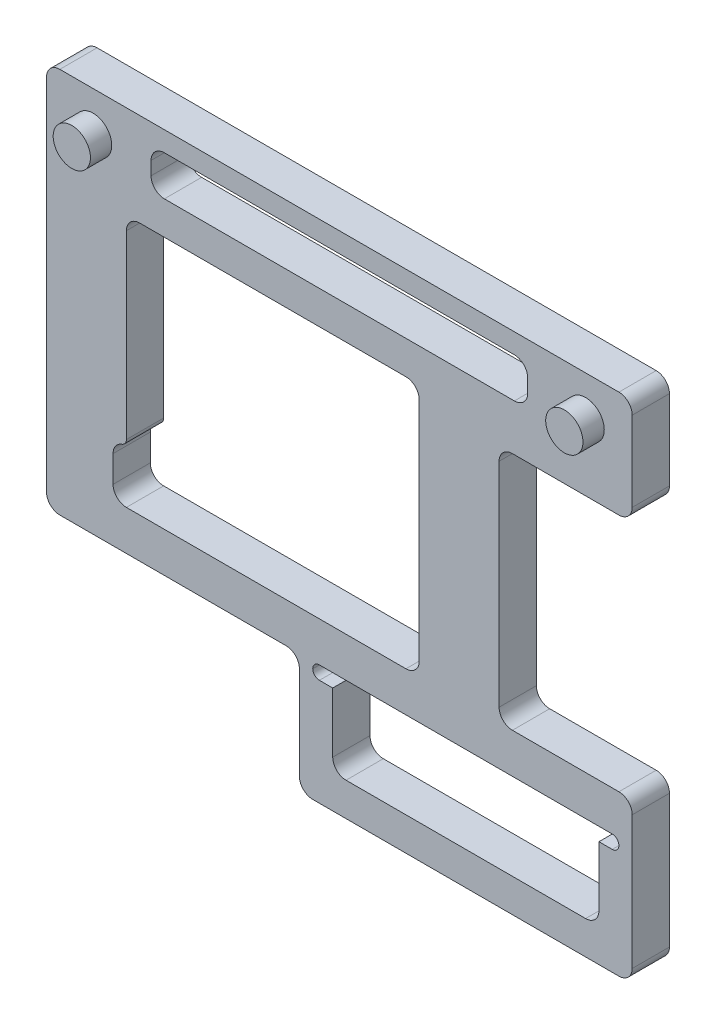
ISO-10303-21;
HEADER;
FILE_DESCRIPTION(('STEP AP214'),'2;1');
FILE_NAME('part.step','',(''),(''),'','','');
FILE_SCHEMA(('AUTOMOTIVE_DESIGN { 1 0 10303 214 1 1 1 1 }'));
ENDSEC;
DATA;
#1=APPLICATION_CONTEXT('core data for automotive mechanical design processes');
#2=APPLICATION_PROTOCOL_DEFINITION('international standard','automotive_design',2000,#1);
#3=PRODUCT_CONTEXT('',#1,'mechanical');
#4=PRODUCT('Part','Part','',(#3));
#5=PRODUCT_RELATED_PRODUCT_CATEGORY('part','',(#4));
#6=PRODUCT_DEFINITION_FORMATION('','',#4);
#7=PRODUCT_DEFINITION_CONTEXT('part definition',#1,'design');
#8=PRODUCT_DEFINITION('design','',#6,#7);
#9=PRODUCT_DEFINITION_SHAPE('','',#8);
#10=(LENGTH_UNIT() NAMED_UNIT(*) SI_UNIT(.MILLI.,.METRE.));
#11=(NAMED_UNIT(*) PLANE_ANGLE_UNIT() SI_UNIT($,.RADIAN.));
#12=(NAMED_UNIT(*) SI_UNIT($,.STERADIAN.) SOLID_ANGLE_UNIT());
#13=UNCERTAINTY_MEASURE_WITH_UNIT(LENGTH_MEASURE(1.E-05),#10,'distance_accuracy_value','');
#14=(GEOMETRIC_REPRESENTATION_CONTEXT(3) GLOBAL_UNCERTAINTY_ASSIGNED_CONTEXT((#13)) GLOBAL_UNIT_ASSIGNED_CONTEXT((#10,
#11,#12)) REPRESENTATION_CONTEXT('',''));
#15=CARTESIAN_POINT('',(0.,0.,0.));
#16=DIRECTION('',(0.,0.,1.));
#17=DIRECTION('',(1.,0.,0.));
#18=AXIS2_PLACEMENT_3D('',#15,#16,#17);
#19=CARTESIAN_POINT('',(18.5,16.,2.8));
#20=DIRECTION('',(0.,0.,-1.));
#21=DIRECTION('',(-1.,0.,0.));
#22=AXIS2_PLACEMENT_3D('',#19,#20,#21);
#23=CYLINDRICAL_SURFACE('',#22,0.499999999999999);
#24=CARTESIAN_POINT('',(18.5,16.,0.));
#25=DIRECTION('',(0.,0.,1.));
#26=DIRECTION('',(1.,0.,0.));
#27=AXIS2_PLACEMENT_3D('',#24,#25,#26);
#28=CIRCLE('',#27,0.499999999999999);
#29=CARTESIAN_POINT('',(19.,16.,0.));
#30=VERTEX_POINT('',#29);
#31=EDGE_CURVE('E439',#30,#30,#28,.T.);
#32=ORIENTED_EDGE('',*,*,#31,.F.);
#33=EDGE_LOOP('',(#32));
#34=FACE_BOUND('',#33,.T.);
#35=CARTESIAN_POINT('',(18.5,16.,0.8));
#36=DIRECTION('',(0.,0.,1.));
#37=DIRECTION('',(1.,0.,0.));
#38=AXIS2_PLACEMENT_3D('',#35,#36,#37);
#39=CIRCLE('',#38,0.499999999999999);
#40=CARTESIAN_POINT('',(19.,16.,0.8));
#41=VERTEX_POINT('',#40);
#42=EDGE_CURVE('E747',#41,#41,#39,.T.);
#43=ORIENTED_EDGE('',*,*,#42,.T.);
#44=EDGE_LOOP('',(#43));
#45=FACE_BOUND('',#44,.T.);
#46=ADVANCED_FACE('F43',(#34,#45),#23,.F.);
#47=CARTESIAN_POINT('',(-18.5,16.,2.8));
#48=DIRECTION('',(0.,0.,-1.));
#49=DIRECTION('',(-1.,0.,0.));
#50=AXIS2_PLACEMENT_3D('',#47,#48,#49);
#51=CYLINDRICAL_SURFACE('',#50,0.499999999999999);
#52=CARTESIAN_POINT('',(-18.5,16.,0.));
#53=DIRECTION('',(0.,0.,1.));
#54=DIRECTION('',(1.,0.,0.));
#55=AXIS2_PLACEMENT_3D('',#52,#53,#54);
#56=CIRCLE('',#55,0.499999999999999);
#57=CARTESIAN_POINT('',(-18.,16.,0.));
#58=VERTEX_POINT('',#57);
#59=EDGE_CURVE('E455',#58,#58,#56,.T.);
#60=ORIENTED_EDGE('',*,*,#59,.F.);
#61=EDGE_LOOP('',(#60));
#62=FACE_BOUND('',#61,.T.);
#63=CARTESIAN_POINT('',(-18.5,16.,0.8));
#64=DIRECTION('',(0.,0.,1.));
#65=DIRECTION('',(1.,0.,0.));
#66=AXIS2_PLACEMENT_3D('',#63,#64,#65);
#67=CIRCLE('',#66,0.499999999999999);
#68=CARTESIAN_POINT('',(-18.,16.,0.8));
#69=VERTEX_POINT('',#68);
#70=EDGE_CURVE('E742',#69,#69,#67,.T.);
#71=ORIENTED_EDGE('',*,*,#70,.T.);
#72=EDGE_LOOP('',(#71));
#73=FACE_BOUND('',#72,.T.);
#74=ADVANCED_FACE('F830',(#62,#73),#51,.F.);
#75=CARTESIAN_POINT('',(0.,0.,2.8));
#76=DIRECTION('',(0.,0.,1.));
#77=DIRECTION('',(1.,0.,0.));
#78=AXIS2_PLACEMENT_3D('',#75,#76,#77);
#79=PLANE('',#78);
#80=CARTESIAN_POINT('',(18.5,16.,2.8));
#81=DIRECTION('',(0.,0.,1.));
#82=DIRECTION('',(1.,0.,0.));
#83=AXIS2_PLACEMENT_3D('',#80,#81,#82);
#84=CIRCLE('',#83,1.4);
#85=CARTESIAN_POINT('',(19.9,16.,2.8));
#86=VERTEX_POINT('',#85);
#87=EDGE_CURVE('E11',#86,#86,#84,.T.);
#88=ORIENTED_EDGE('',*,*,#87,.F.);
#89=EDGE_LOOP('',(#88));
#90=FACE_BOUND('',#89,.T.);
#91=CARTESIAN_POINT('',(-18.5,16.,2.8));
#92=DIRECTION('',(0.,0.,1.));
#93=DIRECTION('',(1.,0.,0.));
#94=AXIS2_PLACEMENT_3D('',#91,#92,#93);
#95=CIRCLE('',#94,1.4);
#96=CARTESIAN_POINT('',(-17.1,16.,2.8));
#97=VERTEX_POINT('',#96);
#98=EDGE_CURVE('E51',#97,#97,#95,.T.);
#99=ORIENTED_EDGE('',*,*,#98,.F.);
#100=EDGE_LOOP('',(#99));
#101=FACE_BOUND('',#100,.T.);
#102=DIRECTION('',(0.,-1.,0.));
#103=VECTOR('',#102,1.);
#104=CARTESIAN_POINT('',(-22.,19.,2.8));
#105=LINE('',#104,#103);
#106=CARTESIAN_POINT('',(-22.,18.,2.8));
#107=VERTEX_POINT('',#106);
#108=CARTESIAN_POINT('',(-22.,-9.00000000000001,2.8));
#109=VERTEX_POINT('',#108);
#110=EDGE_CURVE('E466',#107,#109,#105,.T.);
#111=ORIENTED_EDGE('',*,*,#110,.T.);
#112=CARTESIAN_POINT('',(-21.,-9.00000000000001,2.8));
#113=DIRECTION('',(0.,0.,1.));
#114=DIRECTION('',(1.,0.,0.));
#115=AXIS2_PLACEMENT_3D('',#112,#113,#114);
#116=CIRCLE('',#115,1.);
#117=CARTESIAN_POINT('',(-21.,-10.,2.8));
#118=VERTEX_POINT('',#117);
#119=EDGE_CURVE('E591',#109,#118,#116,.T.);
#120=ORIENTED_EDGE('',*,*,#119,.T.);
#121=DIRECTION('',(1.,0.,0.));
#122=VECTOR('',#121,1.);
#123=CARTESIAN_POINT('',(-22.,-10.,2.8));
#124=LINE('',#123,#122);
#125=CARTESIAN_POINT('',(-3.99999999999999,-10.,2.8));
#126=VERTEX_POINT('',#125);
#127=EDGE_CURVE('E469',#118,#126,#124,.T.);
#128=ORIENTED_EDGE('',*,*,#127,.T.);
#129=CARTESIAN_POINT('',(-3.99999999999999,-11.,2.8));
#130=DIRECTION('',(0.,0.,1.));
#131=DIRECTION('',(1.,0.,0.));
#132=AXIS2_PLACEMENT_3D('',#129,#130,#131);
#133=CIRCLE('',#132,1.);
#134=CARTESIAN_POINT('',(-2.99999999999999,-11.,2.8));
#135=VERTEX_POINT('',#134);
#136=EDGE_CURVE('E678',#126,#135,#133,.F.);
#137=ORIENTED_EDGE('',*,*,#136,.T.);
#138=DIRECTION('',(0.,-1.,0.));
#139=VECTOR('',#138,1.);
#140=CARTESIAN_POINT('',(-2.99999999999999,-10.,2.8));
#141=LINE('',#140,#139);
#142=CARTESIAN_POINT('',(-2.99999999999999,-18.,2.8));
#143=VERTEX_POINT('',#142);
#144=EDGE_CURVE('E472',#135,#143,#141,.T.);
#145=ORIENTED_EDGE('',*,*,#144,.T.);
#146=CARTESIAN_POINT('',(-1.99999999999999,-18.,2.8));
#147=DIRECTION('',(0.,0.,1.));
#148=DIRECTION('',(1.,0.,0.));
#149=AXIS2_PLACEMENT_3D('',#146,#147,#148);
#150=CIRCLE('',#149,1.);
#151=CARTESIAN_POINT('',(-1.99999999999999,-19.,2.8));
#152=VERTEX_POINT('',#151);
#153=EDGE_CURVE('E589',#143,#152,#150,.T.);
#154=ORIENTED_EDGE('',*,*,#153,.T.);
#155=DIRECTION('',(1.,0.,0.));
#156=VECTOR('',#155,1.);
#157=CARTESIAN_POINT('',(22.,-19.,2.8));
#158=LINE('',#157,#156);
#159=CARTESIAN_POINT('',(21.,-19.,2.8));
#160=VERTEX_POINT('',#159);
#161=EDGE_CURVE('E475',#152,#160,#158,.T.);
#162=ORIENTED_EDGE('',*,*,#161,.T.);
#163=CARTESIAN_POINT('',(21.,-18.,2.8));
#164=DIRECTION('',(0.,0.,1.));
#165=DIRECTION('',(1.,0.,0.));
#166=AXIS2_PLACEMENT_3D('',#163,#164,#165);
#167=CIRCLE('',#166,1.);
#168=CARTESIAN_POINT('',(22.,-18.,2.8));
#169=VERTEX_POINT('',#168);
#170=EDGE_CURVE('E587',#160,#169,#167,.T.);
#171=ORIENTED_EDGE('',*,*,#170,.T.);
#172=DIRECTION('',(0.,1.,0.));
#173=VECTOR('',#172,1.);
#174=CARTESIAN_POINT('',(22.,-7.,2.8));
#175=LINE('',#174,#173);
#176=CARTESIAN_POINT('',(22.,-8.,2.8));
#177=VERTEX_POINT('',#176);
#178=EDGE_CURVE('E478',#169,#177,#175,.T.);
#179=ORIENTED_EDGE('',*,*,#178,.T.);
#180=CARTESIAN_POINT('',(21.,-8.,2.8));
#181=DIRECTION('',(0.,0.,1.));
#182=DIRECTION('',(1.,0.,0.));
#183=AXIS2_PLACEMENT_3D('',#180,#181,#182);
#184=CIRCLE('',#183,1.);
#185=CARTESIAN_POINT('',(21.,-7.,2.8));
#186=VERTEX_POINT('',#185);
#187=EDGE_CURVE('E585',#177,#186,#184,.T.);
#188=ORIENTED_EDGE('',*,*,#187,.T.);
#189=DIRECTION('',(-1.,0.,0.));
#190=VECTOR('',#189,1.);
#191=CARTESIAN_POINT('',(22.,-7.,2.8));
#192=LINE('',#191,#190);
#193=CARTESIAN_POINT('',(13.,-7.,2.8));
#194=VERTEX_POINT('',#193);
#195=EDGE_CURVE('E481',#186,#194,#192,.T.);
#196=ORIENTED_EDGE('',*,*,#195,.T.);
#197=CARTESIAN_POINT('',(13.,-6.,2.8));
#198=DIRECTION('',(0.,0.,1.));
#199=DIRECTION('',(1.,0.,0.));
#200=AXIS2_PLACEMENT_3D('',#197,#198,#199);
#201=CIRCLE('',#200,1.);
#202=CARTESIAN_POINT('',(12.,-6.,2.8));
#203=VERTEX_POINT('',#202);
#204=EDGE_CURVE('E690',#194,#203,#201,.F.);
#205=ORIENTED_EDGE('',*,*,#204,.T.);
#206=DIRECTION('',(0.,1.,0.));
#207=VECTOR('',#206,1.);
#208=CARTESIAN_POINT('',(12.,-7.,2.8));
#209=LINE('',#208,#207);
#210=CARTESIAN_POINT('',(12.,10.,2.8));
#211=VERTEX_POINT('',#210);
#212=EDGE_CURVE('E484',#203,#211,#209,.T.);
#213=ORIENTED_EDGE('',*,*,#212,.T.);
#214=CARTESIAN_POINT('',(13.,10.,2.8));
#215=DIRECTION('',(0.,0.,1.));
#216=DIRECTION('',(1.,0.,0.));
#217=AXIS2_PLACEMENT_3D('',#214,#215,#216);
#218=CIRCLE('',#217,1.);
#219=CARTESIAN_POINT('',(13.,11.,2.8));
#220=VERTEX_POINT('',#219);
#221=EDGE_CURVE('E694',#211,#220,#218,.F.);
#222=ORIENTED_EDGE('',*,*,#221,.T.);
#223=DIRECTION('',(1.,0.,0.));
#224=VECTOR('',#223,1.);
#225=CARTESIAN_POINT('',(12.,11.,2.8));
#226=LINE('',#225,#224);
#227=CARTESIAN_POINT('',(21.,11.,2.8));
#228=VERTEX_POINT('',#227);
#229=EDGE_CURVE('E487',#220,#228,#226,.T.);
#230=ORIENTED_EDGE('',*,*,#229,.T.);
#231=CARTESIAN_POINT('',(21.,12.,2.8));
#232=DIRECTION('',(0.,0.,1.));
#233=DIRECTION('',(1.,0.,0.));
#234=AXIS2_PLACEMENT_3D('',#231,#232,#233);
#235=CIRCLE('',#234,1.);
#236=CARTESIAN_POINT('',(22.,12.,2.8));
#237=VERTEX_POINT('',#236);
#238=EDGE_CURVE('E583',#228,#237,#235,.T.);
#239=ORIENTED_EDGE('',*,*,#238,.T.);
#240=DIRECTION('',(0.,1.,0.));
#241=VECTOR('',#240,1.);
#242=CARTESIAN_POINT('',(22.,19.,2.8));
#243=LINE('',#242,#241);
#244=CARTESIAN_POINT('',(22.,18.,2.8));
#245=VERTEX_POINT('',#244);
#246=EDGE_CURVE('E459',#237,#245,#243,.T.);
#247=ORIENTED_EDGE('',*,*,#246,.T.);
#248=CARTESIAN_POINT('',(21.,18.,2.8));
#249=DIRECTION('',(0.,0.,1.));
#250=DIRECTION('',(1.,0.,0.));
#251=AXIS2_PLACEMENT_3D('',#248,#249,#250);
#252=CIRCLE('',#251,1.);
#253=CARTESIAN_POINT('',(21.,19.,2.8));
#254=VERTEX_POINT('',#253);
#255=EDGE_CURVE('E581',#245,#254,#252,.T.);
#256=ORIENTED_EDGE('',*,*,#255,.T.);
#257=DIRECTION('',(-1.,0.,0.));
#258=VECTOR('',#257,1.);
#259=CARTESIAN_POINT('',(22.,19.,2.8));
#260=LINE('',#259,#258);
#261=CARTESIAN_POINT('',(-21.,19.,2.8));
#262=VERTEX_POINT('',#261);
#263=EDGE_CURVE('E462',#254,#262,#260,.T.);
#264=ORIENTED_EDGE('',*,*,#263,.T.);
#265=CARTESIAN_POINT('',(-21.,18.,2.8));
#266=DIRECTION('',(0.,0.,1.));
#267=DIRECTION('',(1.,0.,0.));
#268=AXIS2_PLACEMENT_3D('',#265,#266,#267);
#269=CIRCLE('',#268,1.);
#270=EDGE_CURVE('E579',#262,#107,#269,.T.);
#271=ORIENTED_EDGE('',*,*,#270,.T.);
#272=EDGE_LOOP('',(#111,#120,#128,#137,#145,#154,#162,#171,#179,#188,#196,#205,#213,#222,#230,
#239,#247,#256,#264,#271));
#273=FACE_BOUND('',#272,.T.);
#274=CARTESIAN_POINT('',(-16.,-4.,2.8));
#275=DIRECTION('',(0.,0.,1.));
#276=DIRECTION('',(1.,0.,0.));
#277=AXIS2_PLACEMENT_3D('',#274,#275,#276);
#278=CIRCLE('',#277,1.);
#279=CARTESIAN_POINT('',(-17.,-4.,2.8));
#280=VERTEX_POINT('',#279);
#281=CARTESIAN_POINT('',(-16.3333333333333,-3.05719095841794,2.8));
#282=VERTEX_POINT('',#281);
#283=EDGE_CURVE('E657',#280,#282,#278,.F.);
#284=ORIENTED_EDGE('',*,*,#283,.T.);
#285=CARTESIAN_POINT('',(-16.5,-2.58578643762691,2.8));
#286=DIRECTION('',(0.,0.,1.));
#287=DIRECTION('',(1.,0.,0.));
#288=AXIS2_PLACEMENT_3D('',#285,#286,#287);
#289=CIRCLE('',#288,0.5);
#290=CARTESIAN_POINT('',(-16.,-2.58578643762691,2.8));
#291=VERTEX_POINT('',#290);
#292=EDGE_CURVE('E711',#282,#291,#289,.T.);
#293=ORIENTED_EDGE('',*,*,#292,.T.);
#294=DIRECTION('',(0.,-1.,0.));
#295=VECTOR('',#294,1.);
#296=CARTESIAN_POINT('',(-16.,12.,2.8));
#297=LINE('',#296,#295);
#298=CARTESIAN_POINT('',(-16.,11.,2.8));
#299=VERTEX_POINT('',#298);
#300=EDGE_CURVE('E430',#299,#291,#297,.T.);
#301=ORIENTED_EDGE('',*,*,#300,.F.);
#302=CARTESIAN_POINT('',(-15.,11.,2.8));
#303=DIRECTION('',(0.,0.,1.));
#304=DIRECTION('',(1.,0.,0.));
#305=AXIS2_PLACEMENT_3D('',#302,#303,#304);
#306=CIRCLE('',#305,1.);
#307=CARTESIAN_POINT('',(-15.,12.,2.8));
#308=VERTEX_POINT('',#307);
#309=EDGE_CURVE('E670',#299,#308,#306,.F.);
#310=ORIENTED_EDGE('',*,*,#309,.T.);
#311=DIRECTION('',(-1.,0.,0.));
#312=VECTOR('',#311,1.);
#313=CARTESIAN_POINT('',(-16.,12.,2.8));
#314=LINE('',#313,#312);
#315=CARTESIAN_POINT('',(5.00000000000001,12.,2.8));
#316=VERTEX_POINT('',#315);
#317=EDGE_CURVE('E426',#316,#308,#314,.T.);
#318=ORIENTED_EDGE('',*,*,#317,.F.);
#319=CARTESIAN_POINT('',(5.00000000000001,11.,2.8));
#320=DIRECTION('',(0.,0.,1.));
#321=DIRECTION('',(1.,0.,0.));
#322=AXIS2_PLACEMENT_3D('',#319,#320,#321);
#323=CIRCLE('',#322,1.);
#324=CARTESIAN_POINT('',(6.00000000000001,11.,2.8));
#325=VERTEX_POINT('',#324);
#326=EDGE_CURVE('E674',#316,#325,#323,.F.);
#327=ORIENTED_EDGE('',*,*,#326,.T.);
#328=DIRECTION('',(0.,1.,0.));
#329=VECTOR('',#328,1.);
#330=CARTESIAN_POINT('',(6.00000000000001,-6.00000000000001,2.8));
#331=LINE('',#330,#329);
#332=CARTESIAN_POINT('',(6.00000000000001,-6.,2.8));
#333=VERTEX_POINT('',#332);
#334=EDGE_CURVE('E423',#333,#325,#331,.T.);
#335=ORIENTED_EDGE('',*,*,#334,.F.);
#336=CARTESIAN_POINT('',(5.00000000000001,-6.,2.8));
#337=DIRECTION('',(0.,0.,1.));
#338=DIRECTION('',(1.,0.,0.));
#339=AXIS2_PLACEMENT_3D('',#336,#337,#338);
#340=CIRCLE('',#339,1.);
#341=CARTESIAN_POINT('',(5.00000000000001,-7.,2.8));
#342=VERTEX_POINT('',#341);
#343=EDGE_CURVE('E649',#333,#342,#340,.F.);
#344=ORIENTED_EDGE('',*,*,#343,.T.);
#345=DIRECTION('',(1.,0.,0.));
#346=VECTOR('',#345,1.);
#347=CARTESIAN_POINT('',(-17.,-7.,2.8));
#348=LINE('',#347,#346);
#349=CARTESIAN_POINT('',(-16.,-7.,2.8));
#350=VERTEX_POINT('',#349);
#351=EDGE_CURVE('E436',#350,#342,#348,.T.);
#352=ORIENTED_EDGE('',*,*,#351,.F.);
#353=CARTESIAN_POINT('',(-16.,-6.,2.8));
#354=DIRECTION('',(0.,0.,1.));
#355=DIRECTION('',(1.,0.,0.));
#356=AXIS2_PLACEMENT_3D('',#353,#354,#355);
#357=CIRCLE('',#356,1.);
#358=CARTESIAN_POINT('',(-17.,-6.,2.8));
#359=VERTEX_POINT('',#358);
#360=EDGE_CURVE('E653',#350,#359,#357,.F.);
#361=ORIENTED_EDGE('',*,*,#360,.T.);
#362=DIRECTION('',(0.,-1.,0.));
#363=VECTOR('',#362,1.);
#364=CARTESIAN_POINT('',(-17.,-3.00000000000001,2.8));
#365=LINE('',#364,#363);
#366=EDGE_CURVE('E433',#280,#359,#365,.T.);
#367=ORIENTED_EDGE('',*,*,#366,.F.);
#368=EDGE_LOOP('',(#284,#293,#301,#310,#318,#327,#335,#344,#352,#361,#367));
#369=FACE_BOUND('',#368,.T.);
#370=DIRECTION('',(1.,0.,0.));
#371=VECTOR('',#370,1.);
#372=CARTESIAN_POINT('',(21.,-11.,2.8));
#373=LINE('',#372,#371);
#374=CARTESIAN_POINT('',(19.5,-11.,2.8));
#375=VERTEX_POINT('',#374);
#376=CARTESIAN_POINT('',(20.5,-11.,2.8));
#377=VERTEX_POINT('',#376);
#378=EDGE_CURVE('E376',#375,#377,#373,.T.);
#379=ORIENTED_EDGE('',*,*,#378,.F.);
#380=DIRECTION('',(0.,1.,0.));
#381=VECTOR('',#380,1.);
#382=CARTESIAN_POINT('',(19.5,-11.,2.8));
#383=LINE('',#382,#381);
#384=CARTESIAN_POINT('',(19.5,-15.5,2.8));
#385=VERTEX_POINT('',#384);
#386=EDGE_CURVE('E367',#385,#375,#383,.T.);
#387=ORIENTED_EDGE('',*,*,#386,.F.);
#388=CARTESIAN_POINT('',(18.5,-15.5,2.8));
#389=DIRECTION('',(0.,0.,1.));
#390=DIRECTION('',(1.,0.,0.));
#391=AXIS2_PLACEMENT_3D('',#388,#389,#390);
#392=CIRCLE('',#391,1.);
#393=CARTESIAN_POINT('',(18.5,-16.5,2.8));
#394=VERTEX_POINT('',#393);
#395=EDGE_CURVE('E686',#385,#394,#392,.F.);
#396=ORIENTED_EDGE('',*,*,#395,.T.);
#397=DIRECTION('',(1.,0.,0.));
#398=VECTOR('',#397,1.);
#399=CARTESIAN_POINT('',(-0.499999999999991,-16.5,2.8));
#400=LINE('',#399,#398);
#401=CARTESIAN_POINT('',(0.500000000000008,-16.5,2.8));
#402=VERTEX_POINT('',#401);
#403=EDGE_CURVE('E405',#402,#394,#400,.T.);
#404=ORIENTED_EDGE('',*,*,#403,.F.);
#405=CARTESIAN_POINT('',(0.500000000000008,-15.5,2.8));
#406=DIRECTION('',(0.,0.,1.));
#407=DIRECTION('',(1.,0.,0.));
#408=AXIS2_PLACEMENT_3D('',#405,#406,#407);
#409=CIRCLE('',#408,1.);
#410=CARTESIAN_POINT('',(-0.499999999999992,-15.5,2.8));
#411=VERTEX_POINT('',#410);
#412=EDGE_CURVE('E682',#402,#411,#409,.F.);
#413=ORIENTED_EDGE('',*,*,#412,.T.);
#414=DIRECTION('',(0.,-1.,0.));
#415=VECTOR('',#414,1.);
#416=CARTESIAN_POINT('',(-0.499999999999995,-11.,2.8));
#417=LINE('',#416,#415);
#418=CARTESIAN_POINT('',(-0.499999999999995,-11.,2.8));
#419=VERTEX_POINT('',#418);
#420=EDGE_CURVE('E402',#419,#411,#417,.T.);
#421=ORIENTED_EDGE('',*,*,#420,.F.);
#422=DIRECTION('',(1.,0.,0.));
#423=VECTOR('',#422,1.);
#424=CARTESIAN_POINT('',(-2.,-11.,2.8));
#425=LINE('',#424,#423);
#426=CARTESIAN_POINT('',(-1.5,-11.,2.8));
#427=VERTEX_POINT('',#426);
#428=EDGE_CURVE('E397',#427,#419,#425,.T.);
#429=ORIENTED_EDGE('',*,*,#428,.F.);
#430=CARTESIAN_POINT('',(-1.5,-10.5,2.8));
#431=DIRECTION('',(0.,0.,1.));
#432=DIRECTION('',(1.,0.,0.));
#433=AXIS2_PLACEMENT_3D('',#430,#431,#432);
#434=CIRCLE('',#433,0.5);
#435=CARTESIAN_POINT('',(-2.,-10.5,2.8));
#436=VERTEX_POINT('',#435);
#437=EDGE_CURVE('E58',#427,#436,#434,.F.);
#438=ORIENTED_EDGE('',*,*,#437,.T.);
#439=CARTESIAN_POINT('',(-1.5,-10.5,2.8));
#440=DIRECTION('',(0.,0.,1.));
#441=DIRECTION('',(1.,0.,0.));
#442=AXIS2_PLACEMENT_3D('',#439,#440,#441);
#443=CIRCLE('',#442,0.5);
#444=CARTESIAN_POINT('',(-1.5,-10.,2.8));
#445=VERTEX_POINT('',#444);
#446=EDGE_CURVE('E733',#436,#445,#443,.F.);
#447=ORIENTED_EDGE('',*,*,#446,.T.);
#448=DIRECTION('',(-1.,0.,0.));
#449=VECTOR('',#448,1.);
#450=CARTESIAN_POINT('',(-2.,-10.,2.8));
#451=LINE('',#450,#449);
#452=CARTESIAN_POINT('',(20.5,-10.,2.8));
#453=VERTEX_POINT('',#452);
#454=EDGE_CURVE('E394',#453,#445,#451,.T.);
#455=ORIENTED_EDGE('',*,*,#454,.F.);
#456=CARTESIAN_POINT('',(20.5,-10.5,2.8));
#457=DIRECTION('',(0.,0.,1.));
#458=DIRECTION('',(1.,0.,0.));
#459=AXIS2_PLACEMENT_3D('',#456,#457,#458);
#460=CIRCLE('',#459,0.5);
#461=CARTESIAN_POINT('',(21.,-10.5,2.8));
#462=VERTEX_POINT('',#461);
#463=EDGE_CURVE('E727',#453,#462,#460,.F.);
#464=ORIENTED_EDGE('',*,*,#463,.T.);
#465=CARTESIAN_POINT('',(20.5,-10.5,2.8));
#466=DIRECTION('',(0.,0.,1.));
#467=DIRECTION('',(1.,0.,0.));
#468=AXIS2_PLACEMENT_3D('',#465,#466,#467);
#469=CIRCLE('',#468,0.5);
#470=EDGE_CURVE('E393',#462,#377,#469,.F.);
#471=ORIENTED_EDGE('',*,*,#470,.T.);
#472=EDGE_LOOP('',(#379,#387,#396,#404,#413,#421,#429,#438,#447,#455,#464,#471));
#473=FACE_BOUND('',#472,.T.);
#474=DIRECTION('',(-1.,0.,0.));
#475=VECTOR('',#474,1.);
#476=CARTESIAN_POINT('',(-14.1467166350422,17.5,2.8));
#477=LINE('',#476,#475);
#478=CARTESIAN_POINT('',(13.1467166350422,17.5,2.8));
#479=VERTEX_POINT('',#478);
#480=CARTESIAN_POINT('',(-13.1467166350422,17.5,2.8));
#481=VERTEX_POINT('',#480);
#482=EDGE_CURVE('E762',#479,#481,#477,.T.);
#483=ORIENTED_EDGE('',*,*,#482,.F.);
#484=CARTESIAN_POINT('',(13.1467166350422,16.5,2.8));
#485=DIRECTION('',(0.,0.,1.));
#486=DIRECTION('',(1.,0.,0.));
#487=AXIS2_PLACEMENT_3D('',#484,#485,#486);
#488=CIRCLE('',#487,1.);
#489=CARTESIAN_POINT('',(14.1467166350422,16.5,2.8));
#490=VERTEX_POINT('',#489);
#491=EDGE_CURVE('E702',#479,#490,#488,.F.);
#492=ORIENTED_EDGE('',*,*,#491,.T.);
#493=DIRECTION('',(0.,1.,0.));
#494=VECTOR('',#493,1.);
#495=CARTESIAN_POINT('',(14.1467166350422,17.5,2.8));
#496=LINE('',#495,#494);
#497=CARTESIAN_POINT('',(14.1467166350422,15.5,2.8));
#498=VERTEX_POINT('',#497);
#499=EDGE_CURVE('E759',#498,#490,#496,.T.);
#500=ORIENTED_EDGE('',*,*,#499,.F.);
#501=CARTESIAN_POINT('',(13.1467166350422,15.5,2.8));
#502=DIRECTION('',(0.,0.,1.));
#503=DIRECTION('',(1.,0.,0.));
#504=AXIS2_PLACEMENT_3D('',#501,#502,#503);
#505=CIRCLE('',#504,1.);
#506=CARTESIAN_POINT('',(13.1467166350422,14.5,2.8));
#507=VERTEX_POINT('',#506);
#508=EDGE_CURVE('E698',#498,#507,#505,.F.);
#509=ORIENTED_EDGE('',*,*,#508,.T.);
#510=DIRECTION('',(1.,0.,0.));
#511=VECTOR('',#510,1.);
#512=CARTESIAN_POINT('',(-14.1467166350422,14.5,2.8));
#513=LINE('',#512,#511);
#514=CARTESIAN_POINT('',(-13.1467166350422,14.5,2.8));
#515=VERTEX_POINT('',#514);
#516=EDGE_CURVE('E410',#515,#507,#513,.T.);
#517=ORIENTED_EDGE('',*,*,#516,.F.);
#518=CARTESIAN_POINT('',(-13.1467166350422,15.5,2.8));
#519=DIRECTION('',(0.,0.,1.));
#520=DIRECTION('',(1.,0.,0.));
#521=AXIS2_PLACEMENT_3D('',#518,#519,#520);
#522=CIRCLE('',#521,1.);
#523=CARTESIAN_POINT('',(-14.1467166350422,15.5,2.8));
#524=VERTEX_POINT('',#523);
#525=EDGE_CURVE('E662',#515,#524,#522,.F.);
#526=ORIENTED_EDGE('',*,*,#525,.T.);
#527=DIRECTION('',(0.,-1.,0.));
#528=VECTOR('',#527,1.);
#529=CARTESIAN_POINT('',(-14.1467166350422,17.5,2.8));
#530=LINE('',#529,#528);
#531=CARTESIAN_POINT('',(-14.1467166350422,16.5,2.8));
#532=VERTEX_POINT('',#531);
#533=EDGE_CURVE('E766',#532,#524,#530,.T.);
#534=ORIENTED_EDGE('',*,*,#533,.F.);
#535=CARTESIAN_POINT('',(-13.1467166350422,16.5,2.8));
#536=DIRECTION('',(0.,0.,1.));
#537=DIRECTION('',(1.,0.,0.));
#538=AXIS2_PLACEMENT_3D('',#535,#536,#537);
#539=CIRCLE('',#538,1.);
#540=EDGE_CURVE('E666',#532,#481,#539,.F.);
#541=ORIENTED_EDGE('',*,*,#540,.T.);
#542=EDGE_LOOP('',(#483,#492,#500,#509,#517,#526,#534,#541));
#543=FACE_BOUND('',#542,.T.);
#544=ADVANCED_FACE('F390',(#90,#101,#273,#369,#473,#543),#79,.T.);
#545=CARTESIAN_POINT('',(0.,0.,0.));
#546=DIRECTION('',(0.,0.,1.));
#547=DIRECTION('',(1.,0.,0.));
#548=AXIS2_PLACEMENT_3D('',#545,#546,#547);
#549=PLANE('',#548);
#550=DIRECTION('',(1.,0.,0.));
#551=VECTOR('',#550,1.);
#552=CARTESIAN_POINT('',(-0.499999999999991,-16.5,0.));
#553=LINE('',#552,#551);
#554=CARTESIAN_POINT('',(0.500000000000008,-16.5,0.));
#555=VERTEX_POINT('',#554);
#556=CARTESIAN_POINT('',(18.5,-16.5,0.));
#557=VERTEX_POINT('',#556);
#558=EDGE_CURVE('E377',#555,#557,#553,.T.);
#559=ORIENTED_EDGE('',*,*,#558,.T.);
#560=CARTESIAN_POINT('',(18.5,-15.5,0.));
#561=DIRECTION('',(0.,0.,1.));
#562=DIRECTION('',(1.,0.,0.));
#563=AXIS2_PLACEMENT_3D('',#560,#561,#562);
#564=CIRCLE('',#563,1.);
#565=CARTESIAN_POINT('',(19.5,-15.5,0.));
#566=VERTEX_POINT('',#565);
#567=EDGE_CURVE('E684',#557,#566,#564,.T.);
#568=ORIENTED_EDGE('',*,*,#567,.T.);
#569=DIRECTION('',(0.,1.,0.));
#570=VECTOR('',#569,1.);
#571=CARTESIAN_POINT('',(19.5,-11.,0.));
#572=LINE('',#571,#570);
#573=CARTESIAN_POINT('',(19.5,-11.,0.));
#574=VERTEX_POINT('',#573);
#575=EDGE_CURVE('E408',#566,#574,#572,.T.);
#576=ORIENTED_EDGE('',*,*,#575,.T.);
#577=DIRECTION('',(1.,0.,0.));
#578=VECTOR('',#577,1.);
#579=CARTESIAN_POINT('',(21.,-11.,0.));
#580=LINE('',#579,#578);
#581=CARTESIAN_POINT('',(20.5,-11.,0.));
#582=VERTEX_POINT('',#581);
#583=EDGE_CURVE('E386',#574,#582,#580,.T.);
#584=ORIENTED_EDGE('',*,*,#583,.T.);
#585=CARTESIAN_POINT('',(20.5,-10.5,0.));
#586=DIRECTION('',(0.,0.,1.));
#587=DIRECTION('',(1.,0.,0.));
#588=AXIS2_PLACEMENT_3D('',#585,#586,#587);
#589=CIRCLE('',#588,0.5);
#590=CARTESIAN_POINT('',(21.,-10.5,0.));
#591=VERTEX_POINT('',#590);
#592=EDGE_CURVE('E722',#582,#591,#589,.T.);
#593=ORIENTED_EDGE('',*,*,#592,.T.);
#594=CARTESIAN_POINT('',(20.5,-10.5,0.));
#595=DIRECTION('',(0.,0.,1.));
#596=DIRECTION('',(1.,0.,0.));
#597=AXIS2_PLACEMENT_3D('',#594,#595,#596);
#598=CIRCLE('',#597,0.5);
#599=CARTESIAN_POINT('',(20.5,-10.,0.));
#600=VERTEX_POINT('',#599);
#601=EDGE_CURVE('E725',#591,#600,#598,.T.);
#602=ORIENTED_EDGE('',*,*,#601,.T.);
#603=DIRECTION('',(-1.,0.,0.));
#604=VECTOR('',#603,1.);
#605=CARTESIAN_POINT('',(-2.,-10.,0.));
#606=LINE('',#605,#604);
#607=CARTESIAN_POINT('',(-1.5,-10.,0.));
#608=VERTEX_POINT('',#607);
#609=EDGE_CURVE('E412',#600,#608,#606,.T.);
#610=ORIENTED_EDGE('',*,*,#609,.T.);
#611=CARTESIAN_POINT('',(-1.5,-10.5,0.));
#612=DIRECTION('',(0.,0.,1.));
#613=DIRECTION('',(1.,0.,0.));
#614=AXIS2_PLACEMENT_3D('',#611,#612,#613);
#615=CIRCLE('',#614,0.5);
#616=CARTESIAN_POINT('',(-2.,-10.5,0.));
#617=VERTEX_POINT('',#616);
#618=EDGE_CURVE('E66',#608,#617,#615,.T.);
#619=ORIENTED_EDGE('',*,*,#618,.T.);
#620=CARTESIAN_POINT('',(-1.5,-10.5,0.));
#621=DIRECTION('',(0.,0.,1.));
#622=DIRECTION('',(1.,0.,0.));
#623=AXIS2_PLACEMENT_3D('',#620,#621,#622);
#624=CIRCLE('',#623,0.5);
#625=CARTESIAN_POINT('',(-1.5,-11.,0.));
#626=VERTEX_POINT('',#625);
#627=EDGE_CURVE('E729',#617,#626,#624,.T.);
#628=ORIENTED_EDGE('',*,*,#627,.T.);
#629=DIRECTION('',(1.,0.,0.));
#630=VECTOR('',#629,1.);
#631=CARTESIAN_POINT('',(-2.,-11.,0.));
#632=LINE('',#631,#630);
#633=CARTESIAN_POINT('',(-0.499999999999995,-11.,0.));
#634=VERTEX_POINT('',#633);
#635=EDGE_CURVE('E414',#626,#634,#632,.T.);
#636=ORIENTED_EDGE('',*,*,#635,.T.);
#637=DIRECTION('',(0.,-1.,0.));
#638=VECTOR('',#637,1.);
#639=CARTESIAN_POINT('',(-0.499999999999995,-11.,0.));
#640=LINE('',#639,#638);
#641=CARTESIAN_POINT('',(-0.499999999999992,-15.5,0.));
#642=VERTEX_POINT('',#641);
#643=EDGE_CURVE('E416',#634,#642,#640,.T.);
#644=ORIENTED_EDGE('',*,*,#643,.T.);
#645=CARTESIAN_POINT('',(0.500000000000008,-15.5,0.));
#646=DIRECTION('',(0.,0.,1.));
#647=DIRECTION('',(1.,0.,0.));
#648=AXIS2_PLACEMENT_3D('',#645,#646,#647);
#649=CIRCLE('',#648,1.);
#650=EDGE_CURVE('E680',#642,#555,#649,.T.);
#651=ORIENTED_EDGE('',*,*,#650,.T.);
#652=EDGE_LOOP('',(#559,#568,#576,#584,#593,#602,#610,#619,#628,#636,#644,#651));
#653=FACE_BOUND('',#652,.T.);
#654=ORIENTED_EDGE('',*,*,#31,.T.);
#655=EDGE_LOOP('',(#654));
#656=FACE_BOUND('',#655,.T.);
#657=ORIENTED_EDGE('',*,*,#59,.T.);
#658=EDGE_LOOP('',(#657));
#659=FACE_BOUND('',#658,.T.);
#660=DIRECTION('',(1.,0.,0.));
#661=VECTOR('',#660,1.);
#662=CARTESIAN_POINT('',(-22.,-10.,0.));
#663=LINE('',#662,#661);
#664=CARTESIAN_POINT('',(-21.,-10.,0.));
#665=VERTEX_POINT('',#664);
#666=CARTESIAN_POINT('',(-3.99999999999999,-10.,0.));
#667=VERTEX_POINT('',#666);
#668=EDGE_CURVE('E499',#665,#667,#663,.T.);
#669=ORIENTED_EDGE('',*,*,#668,.F.);
#670=CARTESIAN_POINT('',(-21.,-9.00000000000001,0.));
#671=DIRECTION('',(0.,0.,1.));
#672=DIRECTION('',(1.,0.,0.));
#673=AXIS2_PLACEMENT_3D('',#670,#671,#672);
#674=CIRCLE('',#673,1.);
#675=CARTESIAN_POINT('',(-22.,-9.00000000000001,0.));
#676=VERTEX_POINT('',#675);
#677=EDGE_CURVE('E572',#665,#676,#674,.F.);
#678=ORIENTED_EDGE('',*,*,#677,.T.);
#679=DIRECTION('',(0.,-1.,0.));
#680=VECTOR('',#679,1.);
#681=CARTESIAN_POINT('',(-22.,19.,0.));
#682=LINE('',#681,#680);
#683=CARTESIAN_POINT('',(-22.,18.,0.));
#684=VERTEX_POINT('',#683);
#685=EDGE_CURVE('E496',#684,#676,#682,.T.);
#686=ORIENTED_EDGE('',*,*,#685,.F.);
#687=CARTESIAN_POINT('',(-21.,18.,0.));
#688=DIRECTION('',(0.,0.,1.));
#689=DIRECTION('',(1.,0.,0.));
#690=AXIS2_PLACEMENT_3D('',#687,#688,#689);
#691=CIRCLE('',#690,1.);
#692=CARTESIAN_POINT('',(-21.,19.,0.));
#693=VERTEX_POINT('',#692);
#694=EDGE_CURVE('E560',#684,#693,#691,.F.);
#695=ORIENTED_EDGE('',*,*,#694,.T.);
#696=DIRECTION('',(-1.,0.,0.));
#697=VECTOR('',#696,1.);
#698=CARTESIAN_POINT('',(22.,19.,0.));
#699=LINE('',#698,#697);
#700=CARTESIAN_POINT('',(21.,19.,0.));
#701=VERTEX_POINT('',#700);
#702=EDGE_CURVE('E493',#701,#693,#699,.T.);
#703=ORIENTED_EDGE('',*,*,#702,.F.);
#704=CARTESIAN_POINT('',(21.,18.,0.));
#705=DIRECTION('',(0.,0.,1.));
#706=DIRECTION('',(1.,0.,0.));
#707=AXIS2_PLACEMENT_3D('',#704,#705,#706);
#708=CIRCLE('',#707,1.);
#709=CARTESIAN_POINT('',(22.,18.,0.));
#710=VERTEX_POINT('',#709);
#711=EDGE_CURVE('E562',#701,#710,#708,.F.);
#712=ORIENTED_EDGE('',*,*,#711,.T.);
#713=DIRECTION('',(0.,1.,0.));
#714=VECTOR('',#713,1.);
#715=CARTESIAN_POINT('',(22.,19.,0.));
#716=LINE('',#715,#714);
#717=CARTESIAN_POINT('',(22.,12.,0.));
#718=VERTEX_POINT('',#717);
#719=EDGE_CURVE('E458',#718,#710,#716,.T.);
#720=ORIENTED_EDGE('',*,*,#719,.F.);
#721=CARTESIAN_POINT('',(21.,12.,0.));
#722=DIRECTION('',(0.,0.,1.));
#723=DIRECTION('',(1.,0.,0.));
#724=AXIS2_PLACEMENT_3D('',#721,#722,#723);
#725=CIRCLE('',#724,1.);
#726=CARTESIAN_POINT('',(21.,11.,0.));
#727=VERTEX_POINT('',#726);
#728=EDGE_CURVE('E564',#718,#727,#725,.F.);
#729=ORIENTED_EDGE('',*,*,#728,.T.);
#730=DIRECTION('',(1.,0.,0.));
#731=VECTOR('',#730,1.);
#732=CARTESIAN_POINT('',(12.,11.,0.));
#733=LINE('',#732,#731);
#734=CARTESIAN_POINT('',(13.,11.,0.));
#735=VERTEX_POINT('',#734);
#736=EDGE_CURVE('E463',#735,#727,#733,.T.);
#737=ORIENTED_EDGE('',*,*,#736,.F.);
#738=CARTESIAN_POINT('',(13.,10.,0.));
#739=DIRECTION('',(0.,0.,1.));
#740=DIRECTION('',(1.,0.,0.));
#741=AXIS2_PLACEMENT_3D('',#738,#739,#740);
#742=CIRCLE('',#741,1.);
#743=CARTESIAN_POINT('',(12.,10.,0.));
#744=VERTEX_POINT('',#743);
#745=EDGE_CURVE('E692',#735,#744,#742,.T.);
#746=ORIENTED_EDGE('',*,*,#745,.T.);
#747=DIRECTION('',(0.,1.,0.));
#748=VECTOR('',#747,1.);
#749=CARTESIAN_POINT('',(12.,-7.,0.));
#750=LINE('',#749,#748);
#751=CARTESIAN_POINT('',(12.,-6.,0.));
#752=VERTEX_POINT('',#751);
#753=EDGE_CURVE('E514',#752,#744,#750,.T.);
#754=ORIENTED_EDGE('',*,*,#753,.F.);
#755=CARTESIAN_POINT('',(13.,-6.,0.));
#756=DIRECTION('',(0.,0.,1.));
#757=DIRECTION('',(1.,0.,0.));
#758=AXIS2_PLACEMENT_3D('',#755,#756,#757);
#759=CIRCLE('',#758,1.);
#760=CARTESIAN_POINT('',(13.,-7.,0.));
#761=VERTEX_POINT('',#760);
#762=EDGE_CURVE('E688',#752,#761,#759,.T.);
#763=ORIENTED_EDGE('',*,*,#762,.T.);
#764=DIRECTION('',(-1.,0.,0.));
#765=VECTOR('',#764,1.);
#766=CARTESIAN_POINT('',(22.,-7.,0.));
#767=LINE('',#766,#765);
#768=CARTESIAN_POINT('',(21.,-7.,0.));
#769=VERTEX_POINT('',#768);
#770=EDGE_CURVE('E511',#769,#761,#767,.T.);
#771=ORIENTED_EDGE('',*,*,#770,.F.);
#772=CARTESIAN_POINT('',(21.,-8.,0.));
#773=DIRECTION('',(0.,0.,1.));
#774=DIRECTION('',(1.,0.,0.));
#775=AXIS2_PLACEMENT_3D('',#772,#773,#774);
#776=CIRCLE('',#775,1.);
#777=CARTESIAN_POINT('',(22.,-8.,0.));
#778=VERTEX_POINT('',#777);
#779=EDGE_CURVE('E566',#769,#778,#776,.F.);
#780=ORIENTED_EDGE('',*,*,#779,.T.);
#781=DIRECTION('',(0.,1.,0.));
#782=VECTOR('',#781,1.);
#783=CARTESIAN_POINT('',(22.,-7.,0.));
#784=LINE('',#783,#782);
#785=CARTESIAN_POINT('',(22.,-18.,0.));
#786=VERTEX_POINT('',#785);
#787=EDGE_CURVE('E508',#786,#778,#784,.T.);
#788=ORIENTED_EDGE('',*,*,#787,.F.);
#789=CARTESIAN_POINT('',(21.,-18.,0.));
#790=DIRECTION('',(0.,0.,1.));
#791=DIRECTION('',(1.,0.,0.));
#792=AXIS2_PLACEMENT_3D('',#789,#790,#791);
#793=CIRCLE('',#792,1.);
#794=CARTESIAN_POINT('',(21.,-19.,0.));
#795=VERTEX_POINT('',#794);
#796=EDGE_CURVE('E568',#786,#795,#793,.F.);
#797=ORIENTED_EDGE('',*,*,#796,.T.);
#798=DIRECTION('',(1.,0.,0.));
#799=VECTOR('',#798,1.);
#800=CARTESIAN_POINT('',(22.,-19.,0.));
#801=LINE('',#800,#799);
#802=CARTESIAN_POINT('',(-1.99999999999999,-19.,0.));
#803=VERTEX_POINT('',#802);
#804=EDGE_CURVE('E505',#803,#795,#801,.T.);
#805=ORIENTED_EDGE('',*,*,#804,.F.);
#806=CARTESIAN_POINT('',(-1.99999999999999,-18.,0.));
#807=DIRECTION('',(0.,0.,1.));
#808=DIRECTION('',(1.,0.,0.));
#809=AXIS2_PLACEMENT_3D('',#806,#807,#808);
#810=CIRCLE('',#809,1.);
#811=CARTESIAN_POINT('',(-2.99999999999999,-18.,0.));
#812=VERTEX_POINT('',#811);
#813=EDGE_CURVE('E570',#803,#812,#810,.F.);
#814=ORIENTED_EDGE('',*,*,#813,.T.);
#815=DIRECTION('',(0.,-1.,0.));
#816=VECTOR('',#815,1.);
#817=CARTESIAN_POINT('',(-2.99999999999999,-10.,0.));
#818=LINE('',#817,#816);
#819=CARTESIAN_POINT('',(-2.99999999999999,-11.,0.));
#820=VERTEX_POINT('',#819);
#821=EDGE_CURVE('E502',#820,#812,#818,.T.);
#822=ORIENTED_EDGE('',*,*,#821,.F.);
#823=CARTESIAN_POINT('',(-3.99999999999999,-11.,0.));
#824=DIRECTION('',(0.,0.,1.));
#825=DIRECTION('',(1.,0.,0.));
#826=AXIS2_PLACEMENT_3D('',#823,#824,#825);
#827=CIRCLE('',#826,1.);
#828=EDGE_CURVE('E676',#820,#667,#827,.T.);
#829=ORIENTED_EDGE('',*,*,#828,.T.);
#830=EDGE_LOOP('',(#669,#678,#686,#695,#703,#712,#720,#729,#737,#746,#754,#763,#771,#780,#788,
#797,#805,#814,#822,#829));
#831=FACE_BOUND('',#830,.T.);
#832=DIRECTION('',(0.,-1.,0.));
#833=VECTOR('',#832,1.);
#834=CARTESIAN_POINT('',(-16.,12.,0.));
#835=LINE('',#834,#833);
#836=CARTESIAN_POINT('',(-16.,11.,0.));
#837=VERTEX_POINT('',#836);
#838=CARTESIAN_POINT('',(-16.,-2.58578643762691,0.));
#839=VERTEX_POINT('',#838);
#840=EDGE_CURVE('E442',#837,#839,#835,.T.);
#841=ORIENTED_EDGE('',*,*,#840,.T.);
#842=CARTESIAN_POINT('',(-16.5,-2.58578643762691,0.));
#843=DIRECTION('',(0.,0.,1.));
#844=DIRECTION('',(1.,0.,0.));
#845=AXIS2_PLACEMENT_3D('',#842,#843,#844);
#846=CIRCLE('',#845,0.5);
#847=CARTESIAN_POINT('',(-16.3333333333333,-3.05719095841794,0.));
#848=VERTEX_POINT('',#847);
#849=EDGE_CURVE('E707',#839,#848,#846,.F.);
#850=ORIENTED_EDGE('',*,*,#849,.T.);
#851=CARTESIAN_POINT('',(-16.,-4.,0.));
#852=DIRECTION('',(0.,0.,1.));
#853=DIRECTION('',(1.,0.,0.));
#854=AXIS2_PLACEMENT_3D('',#851,#852,#853);
#855=CIRCLE('',#854,1.);
#856=CARTESIAN_POINT('',(-17.,-4.,0.));
#857=VERTEX_POINT('',#856);
#858=EDGE_CURVE('E655',#848,#857,#855,.T.);
#859=ORIENTED_EDGE('',*,*,#858,.T.);
#860=DIRECTION('',(0.,-1.,0.));
#861=VECTOR('',#860,1.);
#862=CARTESIAN_POINT('',(-17.,-6.00000000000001,0.));
#863=LINE('',#862,#861);
#864=CARTESIAN_POINT('',(-17.,-6.,0.));
#865=VERTEX_POINT('',#864);
#866=EDGE_CURVE('E445',#857,#865,#863,.T.);
#867=ORIENTED_EDGE('',*,*,#866,.T.);
#868=CARTESIAN_POINT('',(-16.,-6.,0.));
#869=DIRECTION('',(0.,0.,1.));
#870=DIRECTION('',(1.,0.,0.));
#871=AXIS2_PLACEMENT_3D('',#868,#869,#870);
#872=CIRCLE('',#871,1.);
#873=CARTESIAN_POINT('',(-16.,-7.,0.));
#874=VERTEX_POINT('',#873);
#875=EDGE_CURVE('E651',#865,#874,#872,.T.);
#876=ORIENTED_EDGE('',*,*,#875,.T.);
#877=DIRECTION('',(1.,0.,0.));
#878=VECTOR('',#877,1.);
#879=CARTESIAN_POINT('',(-17.,-7.,0.));
#880=LINE('',#879,#878);
#881=CARTESIAN_POINT('',(5.00000000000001,-7.,0.));
#882=VERTEX_POINT('',#881);
#883=EDGE_CURVE('E448',#874,#882,#880,.T.);
#884=ORIENTED_EDGE('',*,*,#883,.T.);
#885=CARTESIAN_POINT('',(5.00000000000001,-6.,0.));
#886=DIRECTION('',(0.,0.,1.));
#887=DIRECTION('',(1.,0.,0.));
#888=AXIS2_PLACEMENT_3D('',#885,#886,#887);
#889=CIRCLE('',#888,1.);
#890=CARTESIAN_POINT('',(6.00000000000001,-6.,0.));
#891=VERTEX_POINT('',#890);
#892=EDGE_CURVE('E647',#882,#891,#889,.T.);
#893=ORIENTED_EDGE('',*,*,#892,.T.);
#894=DIRECTION('',(0.,1.,0.));
#895=VECTOR('',#894,1.);
#896=CARTESIAN_POINT('',(6.00000000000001,-7.,0.));
#897=LINE('',#896,#895);
#898=CARTESIAN_POINT('',(6.00000000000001,11.,0.));
#899=VERTEX_POINT('',#898);
#900=EDGE_CURVE('E427',#891,#899,#897,.T.);
#901=ORIENTED_EDGE('',*,*,#900,.T.);
#902=CARTESIAN_POINT('',(5.00000000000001,11.,0.));
#903=DIRECTION('',(0.,0.,1.));
#904=DIRECTION('',(1.,0.,0.));
#905=AXIS2_PLACEMENT_3D('',#902,#903,#904);
#906=CIRCLE('',#905,1.);
#907=CARTESIAN_POINT('',(5.00000000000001,12.,0.));
#908=VERTEX_POINT('',#907);
#909=EDGE_CURVE('E672',#899,#908,#906,.T.);
#910=ORIENTED_EDGE('',*,*,#909,.T.);
#911=DIRECTION('',(-1.,0.,0.));
#912=VECTOR('',#911,1.);
#913=CARTESIAN_POINT('',(-16.,12.,0.));
#914=LINE('',#913,#912);
#915=CARTESIAN_POINT('',(-15.,12.,0.));
#916=VERTEX_POINT('',#915);
#917=EDGE_CURVE('E387',#908,#916,#914,.T.);
#918=ORIENTED_EDGE('',*,*,#917,.T.);
#919=CARTESIAN_POINT('',(-15.,11.,0.));
#920=DIRECTION('',(0.,0.,1.));
#921=DIRECTION('',(1.,0.,0.));
#922=AXIS2_PLACEMENT_3D('',#919,#920,#921);
#923=CIRCLE('',#922,1.);
#924=EDGE_CURVE('E668',#916,#837,#923,.T.);
#925=ORIENTED_EDGE('',*,*,#924,.T.);
#926=EDGE_LOOP('',(#841,#850,#859,#867,#876,#884,#893,#901,#910,#918,#925));
#927=FACE_BOUND('',#926,.T.);
#928=DIRECTION('',(1.,0.,0.));
#929=VECTOR('',#928,1.);
#930=CARTESIAN_POINT('',(-14.1467166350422,14.5,0.));
#931=LINE('',#930,#929);
#932=CARTESIAN_POINT('',(-13.1467166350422,14.5,0.));
#933=VERTEX_POINT('',#932);
#934=CARTESIAN_POINT('',(13.1467166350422,14.5,0.));
#935=VERTEX_POINT('',#934);
#936=EDGE_CURVE('E763',#933,#935,#931,.T.);
#937=ORIENTED_EDGE('',*,*,#936,.T.);
#938=CARTESIAN_POINT('',(13.1467166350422,15.5,0.));
#939=DIRECTION('',(0.,0.,1.));
#940=DIRECTION('',(1.,0.,0.));
#941=AXIS2_PLACEMENT_3D('',#938,#939,#940);
#942=CIRCLE('',#941,1.);
#943=CARTESIAN_POINT('',(14.1467166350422,15.5,0.));
#944=VERTEX_POINT('',#943);
#945=EDGE_CURVE('E696',#935,#944,#942,.T.);
#946=ORIENTED_EDGE('',*,*,#945,.T.);
#947=DIRECTION('',(0.,1.,0.));
#948=VECTOR('',#947,1.);
#949=CARTESIAN_POINT('',(14.1467166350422,17.5,0.));
#950=LINE('',#949,#948);
#951=CARTESIAN_POINT('',(14.1467166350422,16.5,0.));
#952=VERTEX_POINT('',#951);
#953=EDGE_CURVE('E738',#944,#952,#950,.T.);
#954=ORIENTED_EDGE('',*,*,#953,.T.);
#955=CARTESIAN_POINT('',(13.1467166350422,16.5,0.));
#956=DIRECTION('',(0.,0.,1.));
#957=DIRECTION('',(1.,0.,0.));
#958=AXIS2_PLACEMENT_3D('',#955,#956,#957);
#959=CIRCLE('',#958,1.);
#960=CARTESIAN_POINT('',(13.1467166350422,17.5,0.));
#961=VERTEX_POINT('',#960);
#962=EDGE_CURVE('E700',#952,#961,#959,.T.);
#963=ORIENTED_EDGE('',*,*,#962,.T.);
#964=DIRECTION('',(-1.,0.,0.));
#965=VECTOR('',#964,1.);
#966=CARTESIAN_POINT('',(-14.1467166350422,17.5,0.));
#967=LINE('',#966,#965);
#968=CARTESIAN_POINT('',(-13.1467166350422,17.5,0.));
#969=VERTEX_POINT('',#968);
#970=EDGE_CURVE('E773',#961,#969,#967,.T.);
#971=ORIENTED_EDGE('',*,*,#970,.T.);
#972=CARTESIAN_POINT('',(-13.1467166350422,16.5,0.));
#973=DIRECTION('',(0.,0.,1.));
#974=DIRECTION('',(1.,0.,0.));
#975=AXIS2_PLACEMENT_3D('',#972,#973,#974);
#976=CIRCLE('',#975,1.);
#977=CARTESIAN_POINT('',(-14.1467166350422,16.5,0.));
#978=VERTEX_POINT('',#977);
#979=EDGE_CURVE('E664',#969,#978,#976,.T.);
#980=ORIENTED_EDGE('',*,*,#979,.T.);
#981=DIRECTION('',(0.,-1.,0.));
#982=VECTOR('',#981,1.);
#983=CARTESIAN_POINT('',(-14.1467166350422,17.5,0.));
#984=LINE('',#983,#982);
#985=CARTESIAN_POINT('',(-14.1467166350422,15.5,0.));
#986=VERTEX_POINT('',#985);
#987=EDGE_CURVE('E776',#978,#986,#984,.T.);
#988=ORIENTED_EDGE('',*,*,#987,.T.);
#989=CARTESIAN_POINT('',(-13.1467166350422,15.5,0.));
#990=DIRECTION('',(0.,0.,1.));
#991=DIRECTION('',(1.,0.,0.));
#992=AXIS2_PLACEMENT_3D('',#989,#990,#991);
#993=CIRCLE('',#992,1.);
#994=EDGE_CURVE('E660',#986,#933,#993,.T.);
#995=ORIENTED_EDGE('',*,*,#994,.T.);
#996=EDGE_LOOP('',(#937,#946,#954,#963,#971,#980,#988,#995));
#997=FACE_BOUND('',#996,.T.);
#998=ADVANCED_FACE('F781',(#653,#656,#659,#831,#927,#997),#549,.F.);
#999=CARTESIAN_POINT('',(22.,19.,2.8));
#1000=DIRECTION('',(-1.,0.,0.));
#1001=DIRECTION('',(0.,-1.,0.));
#1002=AXIS2_PLACEMENT_3D('',#999,#1000,#1001);
#1003=PLANE('',#1002);
#1004=ORIENTED_EDGE('',*,*,#246,.F.);
#1005=DIRECTION('',(0.,0.,-1.));
#1006=VECTOR('',#1005,1.);
#1007=CARTESIAN_POINT('',(22.,12.,2.8));
#1008=LINE('',#1007,#1006);
#1009=EDGE_CURVE('E634',#237,#718,#1008,.T.);
#1010=ORIENTED_EDGE('',*,*,#1009,.T.);
#1011=ORIENTED_EDGE('',*,*,#719,.T.);
#1012=DIRECTION('',(0.,0.,-1.));
#1013=VECTOR('',#1012,1.);
#1014=CARTESIAN_POINT('',(22.,18.,2.8));
#1015=LINE('',#1014,#1013);
#1016=EDGE_CURVE('E632',#710,#245,#1015,.F.);
#1017=ORIENTED_EDGE('',*,*,#1016,.T.);
#1018=EDGE_LOOP('',(#1004,#1010,#1011,#1017));
#1019=FACE_BOUND('',#1018,.T.);
#1020=ADVANCED_FACE('F849',(#1019),#1003,.F.);
#1021=CARTESIAN_POINT('',(22.,19.,2.8));
#1022=DIRECTION('',(0.,-1.,0.));
#1023=DIRECTION('',(1.,0.,0.));
#1024=AXIS2_PLACEMENT_3D('',#1021,#1022,#1023);
#1025=PLANE('',#1024);
#1026=ORIENTED_EDGE('',*,*,#263,.F.);
#1027=DIRECTION('',(0.,0.,-1.));
#1028=VECTOR('',#1027,1.);
#1029=CARTESIAN_POINT('',(21.,19.,2.8));
#1030=LINE('',#1029,#1028);
#1031=EDGE_CURVE('E644',#254,#701,#1030,.T.);
#1032=ORIENTED_EDGE('',*,*,#1031,.T.);
#1033=ORIENTED_EDGE('',*,*,#702,.T.);
#1034=DIRECTION('',(0.,0.,-1.));
#1035=VECTOR('',#1034,1.);
#1036=CARTESIAN_POINT('',(-21.,19.,2.8));
#1037=LINE('',#1036,#1035);
#1038=EDGE_CURVE('E642',#693,#262,#1037,.F.);
#1039=ORIENTED_EDGE('',*,*,#1038,.T.);
#1040=EDGE_LOOP('',(#1026,#1032,#1033,#1039));
#1041=FACE_BOUND('',#1040,.T.);
#1042=ADVANCED_FACE('F881',(#1041),#1025,.F.);
#1043=CARTESIAN_POINT('',(-22.,19.,2.8));
#1044=DIRECTION('',(1.,0.,0.));
#1045=DIRECTION('',(0.,1.,0.));
#1046=AXIS2_PLACEMENT_3D('',#1043,#1044,#1045);
#1047=PLANE('',#1046);
#1048=ORIENTED_EDGE('',*,*,#685,.T.);
#1049=DIRECTION('',(0.,0.,-1.));
#1050=VECTOR('',#1049,1.);
#1051=CARTESIAN_POINT('',(-22.,-9.00000000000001,2.8));
#1052=LINE('',#1051,#1050);
#1053=EDGE_CURVE('E577',#676,#109,#1052,.F.);
#1054=ORIENTED_EDGE('',*,*,#1053,.T.);
#1055=ORIENTED_EDGE('',*,*,#110,.F.);
#1056=DIRECTION('',(0.,0.,-1.));
#1057=VECTOR('',#1056,1.);
#1058=CARTESIAN_POINT('',(-22.,18.,2.8));
#1059=LINE('',#1058,#1057);
#1060=EDGE_CURVE('E574',#107,#684,#1059,.T.);
#1061=ORIENTED_EDGE('',*,*,#1060,.T.);
#1062=EDGE_LOOP('',(#1048,#1054,#1055,#1061));
#1063=FACE_BOUND('',#1062,.T.);
#1064=ADVANCED_FACE('F877',(#1063),#1047,.F.);
#1065=CARTESIAN_POINT('',(-22.,-10.,2.8));
#1066=DIRECTION('',(0.,1.,0.));
#1067=DIRECTION('',(0.,0.,1.));
#1068=AXIS2_PLACEMENT_3D('',#1065,#1066,#1067);
#1069=PLANE('',#1068);
#1070=ORIENTED_EDGE('',*,*,#127,.F.);
#1071=DIRECTION('',(0.,0.,-1.));
#1072=VECTOR('',#1071,1.);
#1073=CARTESIAN_POINT('',(-21.,-10.,2.8));
#1074=LINE('',#1073,#1072);
#1075=EDGE_CURVE('E557',#118,#665,#1074,.T.);
#1076=ORIENTED_EDGE('',*,*,#1075,.T.);
#1077=ORIENTED_EDGE('',*,*,#668,.T.);
#1078=DIRECTION('',(0.,0.,-1.));
#1079=VECTOR('',#1078,1.);
#1080=CARTESIAN_POINT('',(-3.99999999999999,-10.,2.8));
#1081=LINE('',#1080,#1079);
#1082=EDGE_CURVE('E555',#667,#126,#1081,.F.);
#1083=ORIENTED_EDGE('',*,*,#1082,.T.);
#1084=EDGE_LOOP('',(#1070,#1076,#1077,#1083));
#1085=FACE_BOUND('',#1084,.T.);
#1086=ADVANCED_FACE('F873',(#1085),#1069,.F.);
#1087=CARTESIAN_POINT('',(-2.99999999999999,-10.,2.8));
#1088=DIRECTION('',(1.,0.,0.));
#1089=DIRECTION('',(0.,1.,0.));
#1090=AXIS2_PLACEMENT_3D('',#1087,#1088,#1089);
#1091=PLANE('',#1090);
#1092=ORIENTED_EDGE('',*,*,#144,.F.);
#1093=DIRECTION('',(0.,0.,-1.));
#1094=VECTOR('',#1093,1.);
#1095=CARTESIAN_POINT('',(-2.99999999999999,-11.,0.));
#1096=LINE('',#1095,#1094);
#1097=EDGE_CURVE('E595',#135,#820,#1096,.T.);
#1098=ORIENTED_EDGE('',*,*,#1097,.T.);
#1099=ORIENTED_EDGE('',*,*,#821,.T.);
#1100=DIRECTION('',(0.,0.,-1.));
#1101=VECTOR('',#1100,1.);
#1102=CARTESIAN_POINT('',(-2.99999999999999,-18.,2.8));
#1103=LINE('',#1102,#1101);
#1104=EDGE_CURVE('E593',#812,#143,#1103,.F.);
#1105=ORIENTED_EDGE('',*,*,#1104,.T.);
#1106=EDGE_LOOP('',(#1092,#1098,#1099,#1105));
#1107=FACE_BOUND('',#1106,.T.);
#1108=ADVANCED_FACE('F869',(#1107),#1091,.F.);
#1109=CARTESIAN_POINT('',(22.,-19.,2.8));
#1110=DIRECTION('',(0.,1.,0.));
#1111=DIRECTION('',(-1.,0.,0.));
#1112=AXIS2_PLACEMENT_3D('',#1109,#1110,#1111);
#1113=PLANE('',#1112);
#1114=ORIENTED_EDGE('',*,*,#161,.F.);
#1115=DIRECTION('',(0.,0.,-1.));
#1116=VECTOR('',#1115,1.);
#1117=CARTESIAN_POINT('',(-1.99999999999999,-19.,2.8));
#1118=LINE('',#1117,#1116);
#1119=EDGE_CURVE('E600',#152,#803,#1118,.T.);
#1120=ORIENTED_EDGE('',*,*,#1119,.T.);
#1121=ORIENTED_EDGE('',*,*,#804,.T.);
#1122=DIRECTION('',(0.,0.,-1.));
#1123=VECTOR('',#1122,1.);
#1124=CARTESIAN_POINT('',(21.,-19.,2.8));
#1125=LINE('',#1124,#1123);
#1126=EDGE_CURVE('E598',#795,#160,#1125,.F.);
#1127=ORIENTED_EDGE('',*,*,#1126,.T.);
#1128=EDGE_LOOP('',(#1114,#1120,#1121,#1127));
#1129=FACE_BOUND('',#1128,.T.);
#1130=ADVANCED_FACE('F865',(#1129),#1113,.F.);
#1131=CARTESIAN_POINT('',(22.,-7.,2.8));
#1132=DIRECTION('',(-1.,0.,0.));
#1133=DIRECTION('',(0.,-1.,0.));
#1134=AXIS2_PLACEMENT_3D('',#1131,#1132,#1133);
#1135=PLANE('',#1134);
#1136=ORIENTED_EDGE('',*,*,#178,.F.);
#1137=DIRECTION('',(0.,0.,-1.));
#1138=VECTOR('',#1137,1.);
#1139=CARTESIAN_POINT('',(22.,-18.,2.8));
#1140=LINE('',#1139,#1138);
#1141=EDGE_CURVE('E614',#169,#786,#1140,.T.);
#1142=ORIENTED_EDGE('',*,*,#1141,.T.);
#1143=ORIENTED_EDGE('',*,*,#787,.T.);
#1144=DIRECTION('',(0.,0.,-1.));
#1145=VECTOR('',#1144,1.);
#1146=CARTESIAN_POINT('',(22.,-8.,2.8));
#1147=LINE('',#1146,#1145);
#1148=EDGE_CURVE('E612',#778,#177,#1147,.F.);
#1149=ORIENTED_EDGE('',*,*,#1148,.T.);
#1150=EDGE_LOOP('',(#1136,#1142,#1143,#1149));
#1151=FACE_BOUND('',#1150,.T.);
#1152=ADVANCED_FACE('F861',(#1151),#1135,.F.);
#1153=CARTESIAN_POINT('',(22.,-7.,2.8));
#1154=DIRECTION('',(0.,-1.,0.));
#1155=DIRECTION('',(1.,0.,0.));
#1156=AXIS2_PLACEMENT_3D('',#1153,#1154,#1155);
#1157=PLANE('',#1156);
#1158=ORIENTED_EDGE('',*,*,#195,.F.);
#1159=DIRECTION('',(0.,0.,-1.));
#1160=VECTOR('',#1159,1.);
#1161=CARTESIAN_POINT('',(21.,-7.,2.8));
#1162=LINE('',#1161,#1160);
#1163=EDGE_CURVE('E619',#186,#769,#1162,.T.);
#1164=ORIENTED_EDGE('',*,*,#1163,.T.);
#1165=ORIENTED_EDGE('',*,*,#770,.T.);
#1166=DIRECTION('',(0.,0.,-1.));
#1167=VECTOR('',#1166,1.);
#1168=CARTESIAN_POINT('',(13.,-7.,2.8));
#1169=LINE('',#1168,#1167);
#1170=EDGE_CURVE('E617',#761,#194,#1169,.F.);
#1171=ORIENTED_EDGE('',*,*,#1170,.T.);
#1172=EDGE_LOOP('',(#1158,#1164,#1165,#1171));
#1173=FACE_BOUND('',#1172,.T.);
#1174=ADVANCED_FACE('F857',(#1173),#1157,.F.);
#1175=CARTESIAN_POINT('',(12.,-7.,2.8));
#1176=DIRECTION('',(-1.,0.,0.));
#1177=DIRECTION('',(0.,0.,1.));
#1178=AXIS2_PLACEMENT_3D('',#1175,#1176,#1177);
#1179=PLANE('',#1178);
#1180=ORIENTED_EDGE('',*,*,#212,.F.);
#1181=DIRECTION('',(0.,0.,-1.));
#1182=VECTOR('',#1181,1.);
#1183=CARTESIAN_POINT('',(12.,-6.,0.));
#1184=LINE('',#1183,#1182);
#1185=EDGE_CURVE('E624',#203,#752,#1184,.T.);
#1186=ORIENTED_EDGE('',*,*,#1185,.T.);
#1187=ORIENTED_EDGE('',*,*,#753,.T.);
#1188=DIRECTION('',(0.,0.,-1.));
#1189=VECTOR('',#1188,1.);
#1190=CARTESIAN_POINT('',(12.,10.,2.8));
#1191=LINE('',#1190,#1189);
#1192=EDGE_CURVE('E622',#744,#211,#1191,.F.);
#1193=ORIENTED_EDGE('',*,*,#1192,.T.);
#1194=EDGE_LOOP('',(#1180,#1186,#1187,#1193));
#1195=FACE_BOUND('',#1194,.T.);
#1196=ADVANCED_FACE('F853',(#1195),#1179,.F.);
#1197=CARTESIAN_POINT('',(12.,11.,2.8));
#1198=DIRECTION('',(0.,1.,0.));
#1199=DIRECTION('',(0.,0.,1.));
#1200=AXIS2_PLACEMENT_3D('',#1197,#1198,#1199);
#1201=PLANE('',#1200);
#1202=ORIENTED_EDGE('',*,*,#229,.F.);
#1203=DIRECTION('',(0.,0.,-1.));
#1204=VECTOR('',#1203,1.);
#1205=CARTESIAN_POINT('',(13.,11.,0.));
#1206=LINE('',#1205,#1204);
#1207=EDGE_CURVE('E629',#220,#735,#1206,.T.);
#1208=ORIENTED_EDGE('',*,*,#1207,.T.);
#1209=ORIENTED_EDGE('',*,*,#736,.T.);
#1210=DIRECTION('',(0.,0.,-1.));
#1211=VECTOR('',#1210,1.);
#1212=CARTESIAN_POINT('',(21.,11.,2.8));
#1213=LINE('',#1212,#1211);
#1214=EDGE_CURVE('E627',#727,#228,#1213,.F.);
#1215=ORIENTED_EDGE('',*,*,#1214,.T.);
#1216=EDGE_LOOP('',(#1202,#1208,#1209,#1215));
#1217=FACE_BOUND('',#1216,.T.);
#1218=ADVANCED_FACE('F850',(#1217),#1201,.F.);
#1219=CARTESIAN_POINT('',(-16.,12.,2.8));
#1220=DIRECTION('',(0.,-1.,0.));
#1221=DIRECTION('',(0.,0.,-1.));
#1222=AXIS2_PLACEMENT_3D('',#1219,#1220,#1221);
#1223=PLANE('',#1222);
#1224=ORIENTED_EDGE('',*,*,#317,.T.);
#1225=DIRECTION('',(0.,0.,-1.));
#1226=VECTOR('',#1225,1.);
#1227=CARTESIAN_POINT('',(-15.,12.,0.));
#1228=LINE('',#1227,#1226);
#1229=EDGE_CURVE('E550',#308,#916,#1228,.T.);
#1230=ORIENTED_EDGE('',*,*,#1229,.T.);
#1231=ORIENTED_EDGE('',*,*,#917,.F.);
#1232=DIRECTION('',(0.,0.,-1.));
#1233=VECTOR('',#1232,1.);
#1234=CARTESIAN_POINT('',(5.00000000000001,12.,2.8));
#1235=LINE('',#1234,#1233);
#1236=EDGE_CURVE('E548',#908,#316,#1235,.F.);
#1237=ORIENTED_EDGE('',*,*,#1236,.T.);
#1238=EDGE_LOOP('',(#1224,#1230,#1231,#1237));
#1239=FACE_BOUND('',#1238,.T.);
#1240=ADVANCED_FACE('F841',(#1239),#1223,.T.);
#1241=CARTESIAN_POINT('',(-16.,12.,2.8));
#1242=DIRECTION('',(1.,0.,0.));
#1243=DIRECTION('',(0.,0.,-1.));
#1244=AXIS2_PLACEMENT_3D('',#1241,#1242,#1243);
#1245=PLANE('',#1244);
#1246=ORIENTED_EDGE('',*,*,#300,.T.);
#1247=DIRECTION('',(0.,0.,-1.));
#1248=VECTOR('',#1247,1.);
#1249=CARTESIAN_POINT('',(-16.,-2.58578643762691,0.));
#1250=LINE('',#1249,#1248);
#1251=EDGE_CURVE('E704',#291,#839,#1250,.T.);
#1252=ORIENTED_EDGE('',*,*,#1251,.T.);
#1253=ORIENTED_EDGE('',*,*,#840,.F.);
#1254=DIRECTION('',(0.,0.,-1.));
#1255=VECTOR('',#1254,1.);
#1256=CARTESIAN_POINT('',(-16.,11.,2.8));
#1257=LINE('',#1256,#1255);
#1258=EDGE_CURVE('E553',#837,#299,#1257,.F.);
#1259=ORIENTED_EDGE('',*,*,#1258,.T.);
#1260=EDGE_LOOP('',(#1246,#1252,#1253,#1259));
#1261=FACE_BOUND('',#1260,.T.);
#1262=ADVANCED_FACE('F1010',(#1261),#1245,.T.);
#1263=CARTESIAN_POINT('',(-17.,-6.00000000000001,2.8));
#1264=DIRECTION('',(1.,0.,0.));
#1265=DIRECTION('',(0.,0.,-1.));
#1266=AXIS2_PLACEMENT_3D('',#1263,#1264,#1265);
#1267=PLANE('',#1266);
#1268=ORIENTED_EDGE('',*,*,#366,.T.);
#1269=DIRECTION('',(0.,0.,-1.));
#1270=VECTOR('',#1269,1.);
#1271=CARTESIAN_POINT('',(-17.,-6.,0.));
#1272=LINE('',#1271,#1270);
#1273=EDGE_CURVE('E530',#359,#865,#1272,.T.);
#1274=ORIENTED_EDGE('',*,*,#1273,.T.);
#1275=ORIENTED_EDGE('',*,*,#866,.F.);
#1276=DIRECTION('',(0.,0.,-1.));
#1277=VECTOR('',#1276,1.);
#1278=CARTESIAN_POINT('',(-17.,-4.,2.8));
#1279=LINE('',#1278,#1277);
#1280=EDGE_CURVE('E528',#857,#280,#1279,.F.);
#1281=ORIENTED_EDGE('',*,*,#1280,.T.);
#1282=EDGE_LOOP('',(#1268,#1274,#1275,#1281));
#1283=FACE_BOUND('',#1282,.T.);
#1284=ADVANCED_FACE('F1038',(#1283),#1267,.T.);
#1285=CARTESIAN_POINT('',(-17.,-7.,2.8));
#1286=DIRECTION('',(0.,1.,0.));
#1287=DIRECTION('',(0.,0.,1.));
#1288=AXIS2_PLACEMENT_3D('',#1285,#1286,#1287);
#1289=PLANE('',#1288);
#1290=ORIENTED_EDGE('',*,*,#351,.T.);
#1291=DIRECTION('',(0.,0.,-1.));
#1292=VECTOR('',#1291,1.);
#1293=CARTESIAN_POINT('',(5.00000000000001,-7.,0.));
#1294=LINE('',#1293,#1292);
#1295=EDGE_CURVE('E520',#342,#882,#1294,.T.);
#1296=ORIENTED_EDGE('',*,*,#1295,.T.);
#1297=ORIENTED_EDGE('',*,*,#883,.F.);
#1298=DIRECTION('',(0.,0.,-1.));
#1299=VECTOR('',#1298,1.);
#1300=CARTESIAN_POINT('',(-16.,-7.,2.8));
#1301=LINE('',#1300,#1299);
#1302=EDGE_CURVE('E490',#874,#350,#1301,.F.);
#1303=ORIENTED_EDGE('',*,*,#1302,.T.);
#1304=EDGE_LOOP('',(#1290,#1296,#1297,#1303));
#1305=FACE_BOUND('',#1304,.T.);
#1306=ADVANCED_FACE('F1031',(#1305),#1289,.T.);
#1307=CARTESIAN_POINT('',(6.00000000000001,-7.,2.8));
#1308=DIRECTION('',(-1.,0.,0.));
#1309=DIRECTION('',(0.,0.,1.));
#1310=AXIS2_PLACEMENT_3D('',#1307,#1308,#1309);
#1311=PLANE('',#1310);
#1312=ORIENTED_EDGE('',*,*,#900,.F.);
#1313=DIRECTION('',(0.,0.,-1.));
#1314=VECTOR('',#1313,1.);
#1315=CARTESIAN_POINT('',(6.00000000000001,-6.,2.8));
#1316=LINE('',#1315,#1314);
#1317=EDGE_CURVE('E526',#891,#333,#1316,.F.);
#1318=ORIENTED_EDGE('',*,*,#1317,.T.);
#1319=ORIENTED_EDGE('',*,*,#334,.T.);
#1320=DIRECTION('',(0.,0.,-1.));
#1321=VECTOR('',#1320,1.);
#1322=CARTESIAN_POINT('',(6.00000000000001,11.,0.));
#1323=LINE('',#1322,#1321);
#1324=EDGE_CURVE('E523',#325,#899,#1323,.T.);
#1325=ORIENTED_EDGE('',*,*,#1324,.T.);
#1326=EDGE_LOOP('',(#1312,#1318,#1319,#1325));
#1327=FACE_BOUND('',#1326,.T.);
#1328=ADVANCED_FACE('F1025',(#1327),#1311,.T.);
#1329=CARTESIAN_POINT('',(19.5,-11.,2.8));
#1330=DIRECTION('',(-1.,0.,0.));
#1331=DIRECTION('',(0.,0.,1.));
#1332=AXIS2_PLACEMENT_3D('',#1329,#1330,#1331);
#1333=PLANE('',#1332);
#1334=ORIENTED_EDGE('',*,*,#575,.F.);
#1335=DIRECTION('',(0.,0.,-1.));
#1336=VECTOR('',#1335,1.);
#1337=CARTESIAN_POINT('',(19.5,-15.5,2.8));
#1338=LINE('',#1337,#1336);
#1339=EDGE_CURVE('E373',#566,#385,#1338,.F.);
#1340=ORIENTED_EDGE('',*,*,#1339,.T.);
#1341=ORIENTED_EDGE('',*,*,#386,.T.);
#1342=DIRECTION('',(0.,0.,-1.));
#1343=VECTOR('',#1342,1.);
#1344=CARTESIAN_POINT('',(19.5,-11.,2.8));
#1345=LINE('',#1344,#1343);
#1346=EDGE_CURVE('E371',#375,#574,#1345,.T.);
#1347=ORIENTED_EDGE('',*,*,#1346,.T.);
#1348=EDGE_LOOP('',(#1334,#1340,#1341,#1347));
#1349=FACE_BOUND('',#1348,.T.);
#1350=ADVANCED_FACE('F370',(#1349),#1333,.T.);
#1351=CARTESIAN_POINT('',(21.,-11.,2.8));
#1352=DIRECTION('',(0.,1.,0.));
#1353=DIRECTION('',(0.,0.,1.));
#1354=AXIS2_PLACEMENT_3D('',#1351,#1352,#1353);
#1355=PLANE('',#1354);
#1356=ORIENTED_EDGE('',*,*,#378,.T.);
#1357=DIRECTION('',(0.,0.,-1.));
#1358=VECTOR('',#1357,1.);
#1359=CARTESIAN_POINT('',(20.5,-11.,0.));
#1360=LINE('',#1359,#1358);
#1361=EDGE_CURVE('E713',#377,#582,#1360,.T.);
#1362=ORIENTED_EDGE('',*,*,#1361,.T.);
#1363=ORIENTED_EDGE('',*,*,#583,.F.);
#1364=ORIENTED_EDGE('',*,*,#1346,.F.);
#1365=EDGE_LOOP('',(#1356,#1362,#1363,#1364));
#1366=FACE_BOUND('',#1365,.T.);
#1367=ADVANCED_FACE('F382',(#1366),#1355,.T.);
#1368=CARTESIAN_POINT('',(-2.,-10.,2.8));
#1369=DIRECTION('',(0.,-1.,0.));
#1370=DIRECTION('',(0.,0.,-1.));
#1371=AXIS2_PLACEMENT_3D('',#1368,#1369,#1370);
#1372=PLANE('',#1371);
#1373=ORIENTED_EDGE('',*,*,#609,.F.);
#1374=DIRECTION('',(0.,0.,-1.));
#1375=VECTOR('',#1374,1.);
#1376=CARTESIAN_POINT('',(20.5,-10.,2.8));
#1377=LINE('',#1376,#1375);
#1378=EDGE_CURVE('E717',#600,#453,#1377,.F.);
#1379=ORIENTED_EDGE('',*,*,#1378,.T.);
#1380=ORIENTED_EDGE('',*,*,#454,.T.);
#1381=DIRECTION('',(0.,0.,-1.));
#1382=VECTOR('',#1381,1.);
#1383=CARTESIAN_POINT('',(-1.5,-10.,0.));
#1384=LINE('',#1383,#1382);
#1385=EDGE_CURVE('E715',#445,#608,#1384,.T.);
#1386=ORIENTED_EDGE('',*,*,#1385,.T.);
#1387=EDGE_LOOP('',(#1373,#1379,#1380,#1386));
#1388=FACE_BOUND('',#1387,.T.);
#1389=ADVANCED_FACE('F1097',(#1388),#1372,.T.);
#1390=CARTESIAN_POINT('',(-2.,-11.,2.8));
#1391=DIRECTION('',(0.,1.,0.));
#1392=DIRECTION('',(0.,0.,1.));
#1393=AXIS2_PLACEMENT_3D('',#1390,#1391,#1392);
#1394=PLANE('',#1393);
#1395=ORIENTED_EDGE('',*,*,#635,.F.);
#1396=DIRECTION('',(0.,0.,-1.));
#1397=VECTOR('',#1396,1.);
#1398=CARTESIAN_POINT('',(-1.5,-11.,2.8));
#1399=LINE('',#1398,#1397);
#1400=EDGE_CURVE('E719',#626,#427,#1399,.F.);
#1401=ORIENTED_EDGE('',*,*,#1400,.T.);
#1402=ORIENTED_EDGE('',*,*,#428,.T.);
#1403=DIRECTION('',(0.,0.,-1.));
#1404=VECTOR('',#1403,1.);
#1405=CARTESIAN_POINT('',(-0.499999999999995,-11.,2.8));
#1406=LINE('',#1405,#1404);
#1407=EDGE_CURVE('E388',#419,#634,#1406,.T.);
#1408=ORIENTED_EDGE('',*,*,#1407,.T.);
#1409=EDGE_LOOP('',(#1395,#1401,#1402,#1408));
#1410=FACE_BOUND('',#1409,.T.);
#1411=ADVANCED_FACE('F1075',(#1410),#1394,.T.);
#1412=CARTESIAN_POINT('',(-0.499999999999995,-11.,2.8));
#1413=DIRECTION('',(1.,0.,0.));
#1414=DIRECTION('',(0.,1.,0.));
#1415=AXIS2_PLACEMENT_3D('',#1412,#1413,#1414);
#1416=PLANE('',#1415);
#1417=ORIENTED_EDGE('',*,*,#420,.T.);
#1418=DIRECTION('',(0.,0.,-1.));
#1419=VECTOR('',#1418,1.);
#1420=CARTESIAN_POINT('',(-0.499999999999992,-15.5,0.));
#1421=LINE('',#1420,#1419);
#1422=EDGE_CURVE('E603',#411,#642,#1421,.T.);
#1423=ORIENTED_EDGE('',*,*,#1422,.T.);
#1424=ORIENTED_EDGE('',*,*,#643,.F.);
#1425=ORIENTED_EDGE('',*,*,#1407,.F.);
#1426=EDGE_LOOP('',(#1417,#1423,#1424,#1425));
#1427=FACE_BOUND('',#1426,.T.);
#1428=ADVANCED_FACE('F1082',(#1427),#1416,.T.);
#1429=CARTESIAN_POINT('',(-0.499999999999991,-16.5,2.8));
#1430=DIRECTION('',(0.,1.,0.));
#1431=DIRECTION('',(0.,0.,1.));
#1432=AXIS2_PLACEMENT_3D('',#1429,#1430,#1431);
#1433=PLANE('',#1432);
#1434=ORIENTED_EDGE('',*,*,#558,.F.);
#1435=DIRECTION('',(0.,0.,-1.));
#1436=VECTOR('',#1435,1.);
#1437=CARTESIAN_POINT('',(0.500000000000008,-16.5,2.8));
#1438=LINE('',#1437,#1436);
#1439=EDGE_CURVE('E609',#555,#402,#1438,.F.);
#1440=ORIENTED_EDGE('',*,*,#1439,.T.);
#1441=ORIENTED_EDGE('',*,*,#403,.T.);
#1442=DIRECTION('',(0.,0.,-1.));
#1443=VECTOR('',#1442,1.);
#1444=CARTESIAN_POINT('',(18.5,-16.5,0.));
#1445=LINE('',#1444,#1443);
#1446=EDGE_CURVE('E606',#394,#557,#1445,.T.);
#1447=ORIENTED_EDGE('',*,*,#1446,.T.);
#1448=EDGE_LOOP('',(#1434,#1440,#1441,#1447));
#1449=FACE_BOUND('',#1448,.T.);
#1450=ADVANCED_FACE('F1088',(#1449),#1433,.T.);
#1451=CARTESIAN_POINT('',(14.1467166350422,17.5,2.8));
#1452=DIRECTION('',(-1.,0.,0.));
#1453=DIRECTION('',(0.,0.,1.));
#1454=AXIS2_PLACEMENT_3D('',#1451,#1452,#1453);
#1455=PLANE('',#1454);
#1456=ORIENTED_EDGE('',*,*,#953,.F.);
#1457=DIRECTION('',(0.,0.,-1.));
#1458=VECTOR('',#1457,1.);
#1459=CARTESIAN_POINT('',(14.1467166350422,15.5,2.8));
#1460=LINE('',#1459,#1458);
#1461=EDGE_CURVE('E640',#944,#498,#1460,.F.);
#1462=ORIENTED_EDGE('',*,*,#1461,.T.);
#1463=ORIENTED_EDGE('',*,*,#499,.T.);
#1464=DIRECTION('',(0.,0.,-1.));
#1465=VECTOR('',#1464,1.);
#1466=CARTESIAN_POINT('',(14.1467166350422,16.5,0.));
#1467=LINE('',#1466,#1465);
#1468=EDGE_CURVE('E637',#490,#952,#1467,.T.);
#1469=ORIENTED_EDGE('',*,*,#1468,.T.);
#1470=EDGE_LOOP('',(#1456,#1462,#1463,#1469));
#1471=FACE_BOUND('',#1470,.T.);
#1472=ADVANCED_FACE('F813',(#1471),#1455,.T.);
#1473=CARTESIAN_POINT('',(-14.1467166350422,17.5,2.8));
#1474=DIRECTION('',(0.,-1.,0.));
#1475=DIRECTION('',(0.,0.,-1.));
#1476=AXIS2_PLACEMENT_3D('',#1473,#1474,#1475);
#1477=PLANE('',#1476);
#1478=ORIENTED_EDGE('',*,*,#482,.T.);
#1479=DIRECTION('',(0.,0.,-1.));
#1480=VECTOR('',#1479,1.);
#1481=CARTESIAN_POINT('',(-13.1467166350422,17.5,0.));
#1482=LINE('',#1481,#1480);
#1483=EDGE_CURVE('E545',#481,#969,#1482,.T.);
#1484=ORIENTED_EDGE('',*,*,#1483,.T.);
#1485=ORIENTED_EDGE('',*,*,#970,.F.);
#1486=DIRECTION('',(0.,0.,-1.));
#1487=VECTOR('',#1486,1.);
#1488=CARTESIAN_POINT('',(13.1467166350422,17.5,2.8));
#1489=LINE('',#1488,#1487);
#1490=EDGE_CURVE('E543',#961,#479,#1489,.F.);
#1491=ORIENTED_EDGE('',*,*,#1490,.T.);
#1492=EDGE_LOOP('',(#1478,#1484,#1485,#1491));
#1493=FACE_BOUND('',#1492,.T.);
#1494=ADVANCED_FACE('F804',(#1493),#1477,.T.);
#1495=CARTESIAN_POINT('',(-14.1467166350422,17.5,2.8));
#1496=DIRECTION('',(1.,0.,0.));
#1497=DIRECTION('',(0.,0.,-1.));
#1498=AXIS2_PLACEMENT_3D('',#1495,#1496,#1497);
#1499=PLANE('',#1498);
#1500=ORIENTED_EDGE('',*,*,#533,.T.);
#1501=DIRECTION('',(0.,0.,-1.));
#1502=VECTOR('',#1501,1.);
#1503=CARTESIAN_POINT('',(-14.1467166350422,15.5,0.));
#1504=LINE('',#1503,#1502);
#1505=EDGE_CURVE('E535',#524,#986,#1504,.T.);
#1506=ORIENTED_EDGE('',*,*,#1505,.T.);
#1507=ORIENTED_EDGE('',*,*,#987,.F.);
#1508=DIRECTION('',(0.,0.,-1.));
#1509=VECTOR('',#1508,1.);
#1510=CARTESIAN_POINT('',(-14.1467166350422,16.5,2.8));
#1511=LINE('',#1510,#1509);
#1512=EDGE_CURVE('E533',#978,#532,#1511,.F.);
#1513=ORIENTED_EDGE('',*,*,#1512,.T.);
#1514=EDGE_LOOP('',(#1500,#1506,#1507,#1513));
#1515=FACE_BOUND('',#1514,.T.);
#1516=ADVANCED_FACE('F796',(#1515),#1499,.T.);
#1517=CARTESIAN_POINT('',(-14.1467166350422,14.5,2.8));
#1518=DIRECTION('',(0.,1.,0.));
#1519=DIRECTION('',(0.,0.,1.));
#1520=AXIS2_PLACEMENT_3D('',#1517,#1518,#1519);
#1521=PLANE('',#1520);
#1522=ORIENTED_EDGE('',*,*,#936,.F.);
#1523=DIRECTION('',(0.,0.,-1.));
#1524=VECTOR('',#1523,1.);
#1525=CARTESIAN_POINT('',(-13.1467166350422,14.5,2.8));
#1526=LINE('',#1525,#1524);
#1527=EDGE_CURVE('E541',#933,#515,#1526,.F.);
#1528=ORIENTED_EDGE('',*,*,#1527,.T.);
#1529=ORIENTED_EDGE('',*,*,#516,.T.);
#1530=DIRECTION('',(0.,0.,-1.));
#1531=VECTOR('',#1530,1.);
#1532=CARTESIAN_POINT('',(13.1467166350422,14.5,0.));
#1533=LINE('',#1532,#1531);
#1534=EDGE_CURVE('E538',#507,#935,#1533,.T.);
#1535=ORIENTED_EDGE('',*,*,#1534,.T.);
#1536=EDGE_LOOP('',(#1522,#1528,#1529,#1535));
#1537=FACE_BOUND('',#1536,.T.);
#1538=ADVANCED_FACE('F785',(#1537),#1521,.T.);
#1539=CARTESIAN_POINT('',(5.00000000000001,-6.,2.8));
#1540=DIRECTION('',(0.,0.,1.));
#1541=DIRECTION('',(1.,0.,0.));
#1542=AXIS2_PLACEMENT_3D('',#1539,#1540,#1541);
#1543=CYLINDRICAL_SURFACE('',#1542,1.);
#1544=ORIENTED_EDGE('',*,*,#343,.F.);
#1545=ORIENTED_EDGE('',*,*,#1317,.F.);
#1546=ORIENTED_EDGE('',*,*,#892,.F.);
#1547=ORIENTED_EDGE('',*,*,#1295,.F.);
#1548=EDGE_LOOP('',(#1544,#1545,#1546,#1547));
#1549=FACE_BOUND('',#1548,.T.);
#1550=ADVANCED_FACE('F889',(#1549),#1543,.F.);
#1551=CARTESIAN_POINT('',(-16.,-6.,2.8));
#1552=DIRECTION('',(0.,0.,1.));
#1553=DIRECTION('',(1.,0.,0.));
#1554=AXIS2_PLACEMENT_3D('',#1551,#1552,#1553);
#1555=CYLINDRICAL_SURFACE('',#1554,1.);
#1556=ORIENTED_EDGE('',*,*,#360,.F.);
#1557=ORIENTED_EDGE('',*,*,#1302,.F.);
#1558=ORIENTED_EDGE('',*,*,#875,.F.);
#1559=ORIENTED_EDGE('',*,*,#1273,.F.);
#1560=EDGE_LOOP('',(#1556,#1557,#1558,#1559));
#1561=FACE_BOUND('',#1560,.T.);
#1562=ADVANCED_FACE('F892',(#1561),#1555,.F.);
#1563=CARTESIAN_POINT('',(-16.,-4.,2.8));
#1564=DIRECTION('',(0.,0.,1.));
#1565=DIRECTION('',(1.,0.,0.));
#1566=AXIS2_PLACEMENT_3D('',#1563,#1564,#1565);
#1567=CYLINDRICAL_SURFACE('',#1566,1.);
#1568=ORIENTED_EDGE('',*,*,#858,.F.);
#1569=DIRECTION('',(0.,0.,1.));
#1570=VECTOR('',#1569,1.);
#1571=CARTESIAN_POINT('',(-16.3333333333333,-3.05719095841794,2.8));
#1572=LINE('',#1571,#1570);
#1573=EDGE_CURVE('E709',#848,#282,#1572,.T.);
#1574=ORIENTED_EDGE('',*,*,#1573,.T.);
#1575=ORIENTED_EDGE('',*,*,#283,.F.);
#1576=ORIENTED_EDGE('',*,*,#1280,.F.);
#1577=EDGE_LOOP('',(#1568,#1574,#1575,#1576));
#1578=FACE_BOUND('',#1577,.T.);
#1579=ADVANCED_FACE('F896',(#1578),#1567,.F.);
#1580=CARTESIAN_POINT('',(-13.1467166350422,15.5,2.8));
#1581=DIRECTION('',(0.,0.,1.));
#1582=DIRECTION('',(1.,0.,0.));
#1583=AXIS2_PLACEMENT_3D('',#1580,#1581,#1582);
#1584=CYLINDRICAL_SURFACE('',#1583,1.);
#1585=ORIENTED_EDGE('',*,*,#525,.F.);
#1586=ORIENTED_EDGE('',*,*,#1527,.F.);
#1587=ORIENTED_EDGE('',*,*,#994,.F.);
#1588=ORIENTED_EDGE('',*,*,#1505,.F.);
#1589=EDGE_LOOP('',(#1585,#1586,#1587,#1588));
#1590=FACE_BOUND('',#1589,.T.);
#1591=ADVANCED_FACE('F790',(#1590),#1584,.F.);
#1592=CARTESIAN_POINT('',(-13.1467166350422,16.5,2.8));
#1593=DIRECTION('',(0.,0.,1.));
#1594=DIRECTION('',(1.,0.,0.));
#1595=AXIS2_PLACEMENT_3D('',#1592,#1593,#1594);
#1596=CYLINDRICAL_SURFACE('',#1595,1.);
#1597=ORIENTED_EDGE('',*,*,#540,.F.);
#1598=ORIENTED_EDGE('',*,*,#1512,.F.);
#1599=ORIENTED_EDGE('',*,*,#979,.F.);
#1600=ORIENTED_EDGE('',*,*,#1483,.F.);
#1601=EDGE_LOOP('',(#1597,#1598,#1599,#1600));
#1602=FACE_BOUND('',#1601,.T.);
#1603=ADVANCED_FACE('F800',(#1602),#1596,.F.);
#1604=CARTESIAN_POINT('',(-15.,11.,2.8));
#1605=DIRECTION('',(0.,0.,1.));
#1606=DIRECTION('',(1.,0.,0.));
#1607=AXIS2_PLACEMENT_3D('',#1604,#1605,#1606);
#1608=CYLINDRICAL_SURFACE('',#1607,1.);
#1609=ORIENTED_EDGE('',*,*,#309,.F.);
#1610=ORIENTED_EDGE('',*,*,#1258,.F.);
#1611=ORIENTED_EDGE('',*,*,#924,.F.);
#1612=ORIENTED_EDGE('',*,*,#1229,.F.);
#1613=EDGE_LOOP('',(#1609,#1610,#1611,#1612));
#1614=FACE_BOUND('',#1613,.T.);
#1615=ADVANCED_FACE('F905',(#1614),#1608,.F.);
#1616=CARTESIAN_POINT('',(5.00000000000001,11.,2.8));
#1617=DIRECTION('',(0.,0.,1.));
#1618=DIRECTION('',(1.,0.,0.));
#1619=AXIS2_PLACEMENT_3D('',#1616,#1617,#1618);
#1620=CYLINDRICAL_SURFACE('',#1619,1.);
#1621=ORIENTED_EDGE('',*,*,#326,.F.);
#1622=ORIENTED_EDGE('',*,*,#1236,.F.);
#1623=ORIENTED_EDGE('',*,*,#909,.F.);
#1624=ORIENTED_EDGE('',*,*,#1324,.F.);
#1625=EDGE_LOOP('',(#1621,#1622,#1623,#1624));
#1626=FACE_BOUND('',#1625,.T.);
#1627=ADVANCED_FACE('F908',(#1626),#1620,.F.);
#1628=CARTESIAN_POINT('',(-21.,-9.00000000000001,2.8));
#1629=DIRECTION('',(0.,0.,-1.));
#1630=DIRECTION('',(-1.,0.,0.));
#1631=AXIS2_PLACEMENT_3D('',#1628,#1629,#1630);
#1632=CYLINDRICAL_SURFACE('',#1631,1.);
#1633=ORIENTED_EDGE('',*,*,#119,.F.);
#1634=ORIENTED_EDGE('',*,*,#1053,.F.);
#1635=ORIENTED_EDGE('',*,*,#677,.F.);
#1636=ORIENTED_EDGE('',*,*,#1075,.F.);
#1637=EDGE_LOOP('',(#1633,#1634,#1635,#1636));
#1638=FACE_BOUND('',#1637,.T.);
#1639=ADVANCED_FACE('F912',(#1638),#1632,.T.);
#1640=CARTESIAN_POINT('',(-3.99999999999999,-11.,2.8));
#1641=DIRECTION('',(0.,0.,1.));
#1642=DIRECTION('',(1.,0.,0.));
#1643=AXIS2_PLACEMENT_3D('',#1640,#1641,#1642);
#1644=CYLINDRICAL_SURFACE('',#1643,1.);
#1645=ORIENTED_EDGE('',*,*,#136,.F.);
#1646=ORIENTED_EDGE('',*,*,#1082,.F.);
#1647=ORIENTED_EDGE('',*,*,#828,.F.);
#1648=ORIENTED_EDGE('',*,*,#1097,.F.);
#1649=EDGE_LOOP('',(#1645,#1646,#1647,#1648));
#1650=FACE_BOUND('',#1649,.T.);
#1651=ADVANCED_FACE('F916',(#1650),#1644,.F.);
#1652=CARTESIAN_POINT('',(-1.99999999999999,-18.,2.8));
#1653=DIRECTION('',(0.,0.,-1.));
#1654=DIRECTION('',(-1.,0.,0.));
#1655=AXIS2_PLACEMENT_3D('',#1652,#1653,#1654);
#1656=CYLINDRICAL_SURFACE('',#1655,1.);
#1657=ORIENTED_EDGE('',*,*,#153,.F.);
#1658=ORIENTED_EDGE('',*,*,#1104,.F.);
#1659=ORIENTED_EDGE('',*,*,#813,.F.);
#1660=ORIENTED_EDGE('',*,*,#1119,.F.);
#1661=EDGE_LOOP('',(#1657,#1658,#1659,#1660));
#1662=FACE_BOUND('',#1661,.T.);
#1663=ADVANCED_FACE('F920',(#1662),#1656,.T.);
#1664=CARTESIAN_POINT('',(0.500000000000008,-15.5,2.8));
#1665=DIRECTION('',(0.,0.,1.));
#1666=DIRECTION('',(1.,0.,0.));
#1667=AXIS2_PLACEMENT_3D('',#1664,#1665,#1666);
#1668=CYLINDRICAL_SURFACE('',#1667,1.);
#1669=ORIENTED_EDGE('',*,*,#412,.F.);
#1670=ORIENTED_EDGE('',*,*,#1439,.F.);
#1671=ORIENTED_EDGE('',*,*,#650,.F.);
#1672=ORIENTED_EDGE('',*,*,#1422,.F.);
#1673=EDGE_LOOP('',(#1669,#1670,#1671,#1672));
#1674=FACE_BOUND('',#1673,.T.);
#1675=ADVANCED_FACE('F924',(#1674),#1668,.F.);
#1676=CARTESIAN_POINT('',(18.5,-15.5,2.8));
#1677=DIRECTION('',(0.,0.,1.));
#1678=DIRECTION('',(1.,0.,0.));
#1679=AXIS2_PLACEMENT_3D('',#1676,#1677,#1678);
#1680=CYLINDRICAL_SURFACE('',#1679,1.);
#1681=ORIENTED_EDGE('',*,*,#395,.F.);
#1682=ORIENTED_EDGE('',*,*,#1339,.F.);
#1683=ORIENTED_EDGE('',*,*,#567,.F.);
#1684=ORIENTED_EDGE('',*,*,#1446,.F.);
#1685=EDGE_LOOP('',(#1681,#1682,#1683,#1684));
#1686=FACE_BOUND('',#1685,.T.);
#1687=ADVANCED_FACE('F928',(#1686),#1680,.F.);
#1688=CARTESIAN_POINT('',(21.,-18.,2.8));
#1689=DIRECTION('',(0.,0.,-1.));
#1690=DIRECTION('',(-1.,0.,0.));
#1691=AXIS2_PLACEMENT_3D('',#1688,#1689,#1690);
#1692=CYLINDRICAL_SURFACE('',#1691,1.);
#1693=ORIENTED_EDGE('',*,*,#170,.F.);
#1694=ORIENTED_EDGE('',*,*,#1126,.F.);
#1695=ORIENTED_EDGE('',*,*,#796,.F.);
#1696=ORIENTED_EDGE('',*,*,#1141,.F.);
#1697=EDGE_LOOP('',(#1693,#1694,#1695,#1696));
#1698=FACE_BOUND('',#1697,.T.);
#1699=ADVANCED_FACE('F932',(#1698),#1692,.T.);
#1700=CARTESIAN_POINT('',(21.,-8.,2.8));
#1701=DIRECTION('',(0.,0.,-1.));
#1702=DIRECTION('',(-1.,0.,0.));
#1703=AXIS2_PLACEMENT_3D('',#1700,#1701,#1702);
#1704=CYLINDRICAL_SURFACE('',#1703,1.);
#1705=ORIENTED_EDGE('',*,*,#187,.F.);
#1706=ORIENTED_EDGE('',*,*,#1148,.F.);
#1707=ORIENTED_EDGE('',*,*,#779,.F.);
#1708=ORIENTED_EDGE('',*,*,#1163,.F.);
#1709=EDGE_LOOP('',(#1705,#1706,#1707,#1708));
#1710=FACE_BOUND('',#1709,.T.);
#1711=ADVANCED_FACE('F936',(#1710),#1704,.T.);
#1712=CARTESIAN_POINT('',(13.,-6.,2.8));
#1713=DIRECTION('',(0.,0.,1.));
#1714=DIRECTION('',(1.,0.,0.));
#1715=AXIS2_PLACEMENT_3D('',#1712,#1713,#1714);
#1716=CYLINDRICAL_SURFACE('',#1715,1.);
#1717=ORIENTED_EDGE('',*,*,#204,.F.);
#1718=ORIENTED_EDGE('',*,*,#1170,.F.);
#1719=ORIENTED_EDGE('',*,*,#762,.F.);
#1720=ORIENTED_EDGE('',*,*,#1185,.F.);
#1721=EDGE_LOOP('',(#1717,#1718,#1719,#1720));
#1722=FACE_BOUND('',#1721,.T.);
#1723=ADVANCED_FACE('F940',(#1722),#1716,.F.);
#1724=CARTESIAN_POINT('',(13.,10.,2.8));
#1725=DIRECTION('',(0.,0.,1.));
#1726=DIRECTION('',(1.,0.,0.));
#1727=AXIS2_PLACEMENT_3D('',#1724,#1725,#1726);
#1728=CYLINDRICAL_SURFACE('',#1727,1.);
#1729=ORIENTED_EDGE('',*,*,#221,.F.);
#1730=ORIENTED_EDGE('',*,*,#1192,.F.);
#1731=ORIENTED_EDGE('',*,*,#745,.F.);
#1732=ORIENTED_EDGE('',*,*,#1207,.F.);
#1733=EDGE_LOOP('',(#1729,#1730,#1731,#1732));
#1734=FACE_BOUND('',#1733,.T.);
#1735=ADVANCED_FACE('F826',(#1734),#1728,.F.);
#1736=CARTESIAN_POINT('',(21.,12.,2.8));
#1737=DIRECTION('',(0.,0.,-1.));
#1738=DIRECTION('',(-1.,0.,0.));
#1739=AXIS2_PLACEMENT_3D('',#1736,#1737,#1738);
#1740=CYLINDRICAL_SURFACE('',#1739,1.);
#1741=ORIENTED_EDGE('',*,*,#238,.F.);
#1742=ORIENTED_EDGE('',*,*,#1214,.F.);
#1743=ORIENTED_EDGE('',*,*,#728,.F.);
#1744=ORIENTED_EDGE('',*,*,#1009,.F.);
#1745=EDGE_LOOP('',(#1741,#1742,#1743,#1744));
#1746=FACE_BOUND('',#1745,.T.);
#1747=ADVANCED_FACE('F818',(#1746),#1740,.T.);
#1748=CARTESIAN_POINT('',(13.1467166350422,15.5,2.8));
#1749=DIRECTION('',(0.,0.,1.));
#1750=DIRECTION('',(1.,0.,0.));
#1751=AXIS2_PLACEMENT_3D('',#1748,#1749,#1750);
#1752=CYLINDRICAL_SURFACE('',#1751,1.);
#1753=ORIENTED_EDGE('',*,*,#508,.F.);
#1754=ORIENTED_EDGE('',*,*,#1461,.F.);
#1755=ORIENTED_EDGE('',*,*,#945,.F.);
#1756=ORIENTED_EDGE('',*,*,#1534,.F.);
#1757=EDGE_LOOP('',(#1753,#1754,#1755,#1756));
#1758=FACE_BOUND('',#1757,.T.);
#1759=ADVANCED_FACE('F816',(#1758),#1752,.F.);
#1760=CARTESIAN_POINT('',(13.1467166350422,16.5,2.8));
#1761=DIRECTION('',(0.,0.,1.));
#1762=DIRECTION('',(1.,0.,0.));
#1763=AXIS2_PLACEMENT_3D('',#1760,#1761,#1762);
#1764=CYLINDRICAL_SURFACE('',#1763,1.);
#1765=ORIENTED_EDGE('',*,*,#491,.F.);
#1766=ORIENTED_EDGE('',*,*,#1490,.F.);
#1767=ORIENTED_EDGE('',*,*,#962,.F.);
#1768=ORIENTED_EDGE('',*,*,#1468,.F.);
#1769=EDGE_LOOP('',(#1765,#1766,#1767,#1768));
#1770=FACE_BOUND('',#1769,.T.);
#1771=ADVANCED_FACE('F808',(#1770),#1764,.F.);
#1772=CARTESIAN_POINT('',(21.,18.,2.8));
#1773=DIRECTION('',(0.,0.,-1.));
#1774=DIRECTION('',(-1.,0.,0.));
#1775=AXIS2_PLACEMENT_3D('',#1772,#1773,#1774);
#1776=CYLINDRICAL_SURFACE('',#1775,1.);
#1777=ORIENTED_EDGE('',*,*,#255,.F.);
#1778=ORIENTED_EDGE('',*,*,#1016,.F.);
#1779=ORIENTED_EDGE('',*,*,#711,.F.);
#1780=ORIENTED_EDGE('',*,*,#1031,.F.);
#1781=EDGE_LOOP('',(#1777,#1778,#1779,#1780));
#1782=FACE_BOUND('',#1781,.T.);
#1783=ADVANCED_FACE('F824',(#1782),#1776,.T.);
#1784=CARTESIAN_POINT('',(-21.,18.,2.8));
#1785=DIRECTION('',(0.,0.,-1.));
#1786=DIRECTION('',(-1.,0.,0.));
#1787=AXIS2_PLACEMENT_3D('',#1784,#1785,#1786);
#1788=CYLINDRICAL_SURFACE('',#1787,1.);
#1789=ORIENTED_EDGE('',*,*,#270,.F.);
#1790=ORIENTED_EDGE('',*,*,#1038,.F.);
#1791=ORIENTED_EDGE('',*,*,#694,.F.);
#1792=ORIENTED_EDGE('',*,*,#1060,.F.);
#1793=EDGE_LOOP('',(#1789,#1790,#1791,#1792));
#1794=FACE_BOUND('',#1793,.T.);
#1795=ADVANCED_FACE('F971',(#1794),#1788,.T.);
#1796=CARTESIAN_POINT('',(-16.5,-2.58578643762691,2.8));
#1797=DIRECTION('',(0.,0.,1.));
#1798=DIRECTION('',(1.,0.,0.));
#1799=AXIS2_PLACEMENT_3D('',#1796,#1797,#1798);
#1800=CYLINDRICAL_SURFACE('',#1799,0.5);
#1801=ORIENTED_EDGE('',*,*,#292,.F.);
#1802=ORIENTED_EDGE('',*,*,#1573,.F.);
#1803=ORIENTED_EDGE('',*,*,#849,.F.);
#1804=ORIENTED_EDGE('',*,*,#1251,.F.);
#1805=EDGE_LOOP('',(#1801,#1802,#1803,#1804));
#1806=FACE_BOUND('',#1805,.T.);
#1807=ADVANCED_FACE('F1044',(#1806),#1800,.T.);
#1808=CARTESIAN_POINT('',(20.5,-10.5,2.8));
#1809=DIRECTION('',(0.,0.,1.));
#1810=DIRECTION('',(1.,0.,0.));
#1811=AXIS2_PLACEMENT_3D('',#1808,#1809,#1810);
#1812=CYLINDRICAL_SURFACE('',#1811,0.5);
#1813=DIRECTION('',(0.,0.,-1.));
#1814=VECTOR('',#1813,1.);
#1815=CARTESIAN_POINT('',(21.,-10.5,0.));
#1816=LINE('',#1815,#1814);
#1817=EDGE_CURVE('E735',#462,#591,#1816,.T.);
#1818=ORIENTED_EDGE('',*,*,#1817,.F.);
#1819=ORIENTED_EDGE('',*,*,#463,.F.);
#1820=ORIENTED_EDGE('',*,*,#1378,.F.);
#1821=ORIENTED_EDGE('',*,*,#601,.F.);
#1822=EDGE_LOOP('',(#1818,#1819,#1820,#1821));
#1823=FACE_BOUND('',#1822,.T.);
#1824=ADVANCED_FACE('F1046',(#1823),#1812,.F.);
#1825=CARTESIAN_POINT('',(20.5,-10.5,2.8));
#1826=DIRECTION('',(0.,0.,1.));
#1827=DIRECTION('',(1.,0.,0.));
#1828=AXIS2_PLACEMENT_3D('',#1825,#1826,#1827);
#1829=CYLINDRICAL_SURFACE('',#1828,0.5);
#1830=ORIENTED_EDGE('',*,*,#470,.F.);
#1831=ORIENTED_EDGE('',*,*,#1817,.T.);
#1832=ORIENTED_EDGE('',*,*,#592,.F.);
#1833=ORIENTED_EDGE('',*,*,#1361,.F.);
#1834=EDGE_LOOP('',(#1830,#1831,#1832,#1833));
#1835=FACE_BOUND('',#1834,.T.);
#1836=ADVANCED_FACE('F1051',(#1835),#1829,.F.);
#1837=CARTESIAN_POINT('',(-1.5,-10.5,2.8));
#1838=DIRECTION('',(0.,0.,1.));
#1839=DIRECTION('',(1.,0.,0.));
#1840=AXIS2_PLACEMENT_3D('',#1837,#1838,#1839);
#1841=CYLINDRICAL_SURFACE('',#1840,0.5);
#1842=ORIENTED_EDGE('',*,*,#1385,.F.);
#1843=ORIENTED_EDGE('',*,*,#446,.F.);
#1844=DIRECTION('',(0.,0.,-1.));
#1845=VECTOR('',#1844,1.);
#1846=CARTESIAN_POINT('',(-2.,-10.5,2.8));
#1847=LINE('',#1846,#1845);
#1848=EDGE_CURVE('E739',#617,#436,#1847,.F.);
#1849=ORIENTED_EDGE('',*,*,#1848,.F.);
#1850=ORIENTED_EDGE('',*,*,#618,.F.);
#1851=EDGE_LOOP('',(#1842,#1843,#1849,#1850));
#1852=FACE_BOUND('',#1851,.T.);
#1853=ADVANCED_FACE('F45',(#1852),#1841,.F.);
#1854=CARTESIAN_POINT('',(-1.5,-10.5,2.8));
#1855=DIRECTION('',(0.,0.,1.));
#1856=DIRECTION('',(1.,0.,0.));
#1857=AXIS2_PLACEMENT_3D('',#1854,#1855,#1856);
#1858=CYLINDRICAL_SURFACE('',#1857,0.5);
#1859=ORIENTED_EDGE('',*,*,#437,.F.);
#1860=ORIENTED_EDGE('',*,*,#1400,.F.);
#1861=ORIENTED_EDGE('',*,*,#627,.F.);
#1862=ORIENTED_EDGE('',*,*,#1848,.T.);
#1863=EDGE_LOOP('',(#1859,#1860,#1861,#1862));
#1864=FACE_BOUND('',#1863,.T.);
#1865=ADVANCED_FACE('F1060',(#1864),#1858,.F.);
#1866=CARTESIAN_POINT('',(-18.5,16.,0.8));
#1867=DIRECTION('',(0.,0.,1.));
#1868=DIRECTION('',(1.,0.,0.));
#1869=AXIS2_PLACEMENT_3D('',#1866,#1867,#1868);
#1870=PLANE('',#1869);
#1871=ORIENTED_EDGE('',*,*,#70,.F.);
#1872=EDGE_LOOP('',(#1871));
#1873=FACE_BOUND('',#1872,.T.);
#1874=ADVANCED_FACE('F1061',(#1873),#1870,.F.);
#1875=CARTESIAN_POINT('',(-18.5,16.,0.8));
#1876=DIRECTION('',(0.,0.,1.));
#1877=DIRECTION('',(1.,0.,0.));
#1878=AXIS2_PLACEMENT_3D('',#1875,#1876,#1877);
#1879=CYLINDRICAL_SURFACE('',#1878,1.4);
#1880=ORIENTED_EDGE('',*,*,#98,.T.);
#1881=EDGE_LOOP('',(#1880));
#1882=FACE_BOUND('',#1881,.T.);
#1883=CARTESIAN_POINT('',(-18.5,16.,4.4));
#1884=DIRECTION('',(0.,0.,1.));
#1885=DIRECTION('',(1.,0.,0.));
#1886=AXIS2_PLACEMENT_3D('',#1883,#1884,#1885);
#1887=CIRCLE('',#1886,1.4);
#1888=CARTESIAN_POINT('',(-17.1,16.,4.4));
#1889=VERTEX_POINT('',#1888);
#1890=EDGE_CURVE('E745',#1889,#1889,#1887,.T.);
#1891=ORIENTED_EDGE('',*,*,#1890,.F.);
#1892=EDGE_LOOP('',(#1891));
#1893=FACE_BOUND('',#1892,.T.);
#1894=ADVANCED_FACE('F1067',(#1882,#1893),#1879,.T.);
#1895=CARTESIAN_POINT('',(-18.5,16.,4.4));
#1896=DIRECTION('',(0.,0.,1.));
#1897=DIRECTION('',(1.,0.,0.));
#1898=AXIS2_PLACEMENT_3D('',#1895,#1896,#1897);
#1899=PLANE('',#1898);
#1900=ORIENTED_EDGE('',*,*,#1890,.T.);
#1901=EDGE_LOOP('',(#1900));
#1902=FACE_BOUND('',#1901,.T.);
#1903=ADVANCED_FACE('F1343',(#1902),#1899,.T.);
#1904=CARTESIAN_POINT('',(18.5,16.,0.8));
#1905=DIRECTION('',(0.,0.,1.));
#1906=DIRECTION('',(1.,0.,0.));
#1907=AXIS2_PLACEMENT_3D('',#1904,#1905,#1906);
#1908=PLANE('',#1907);
#1909=ORIENTED_EDGE('',*,*,#42,.F.);
#1910=EDGE_LOOP('',(#1909));
#1911=FACE_BOUND('',#1910,.T.);
#1912=ADVANCED_FACE('F1353',(#1911),#1908,.F.);
#1913=CARTESIAN_POINT('',(18.5,16.,0.8));
#1914=DIRECTION('',(0.,0.,1.));
#1915=DIRECTION('',(1.,0.,0.));
#1916=AXIS2_PLACEMENT_3D('',#1913,#1914,#1915);
#1917=CYLINDRICAL_SURFACE('',#1916,1.4);
#1918=ORIENTED_EDGE('',*,*,#87,.T.);
#1919=EDGE_LOOP('',(#1918));
#1920=FACE_BOUND('',#1919,.T.);
#1921=CARTESIAN_POINT('',(18.5,16.,4.4));
#1922=DIRECTION('',(0.,0.,1.));
#1923=DIRECTION('',(1.,0.,0.));
#1924=AXIS2_PLACEMENT_3D('',#1921,#1922,#1923);
#1925=CIRCLE('',#1924,1.4);
#1926=CARTESIAN_POINT('',(19.9,16.,4.4));
#1927=VERTEX_POINT('',#1926);
#1928=EDGE_CURVE('E749',#1927,#1927,#1925,.T.);
#1929=ORIENTED_EDGE('',*,*,#1928,.F.);
#1930=EDGE_LOOP('',(#1929));
#1931=FACE_BOUND('',#1930,.T.);
#1932=ADVANCED_FACE('F1363',(#1920,#1931),#1917,.T.);
#1933=CARTESIAN_POINT('',(18.5,16.,4.4));
#1934=DIRECTION('',(0.,0.,1.));
#1935=DIRECTION('',(1.,0.,0.));
#1936=AXIS2_PLACEMENT_3D('',#1933,#1934,#1935);
#1937=PLANE('',#1936);
#1938=ORIENTED_EDGE('',*,*,#1928,.T.);
#1939=EDGE_LOOP('',(#1938));
#1940=FACE_BOUND('',#1939,.T.);
#1941=ADVANCED_FACE('F1373',(#1940),#1937,.T.);
#1942=CLOSED_SHELL('',(#46,#74,#544,#998,#1020,#1042,#1064,#1086,#1108,#1130,#1152,#1174,#1196,
#1218,#1240,#1262,#1284,#1306,#1328,#1350,#1367,#1389,#1411,#1428,#1450,#1472,#1494,#1516,#1538,
#1550,#1562,#1579,#1591,#1603,#1615,#1627,#1639,#1651,#1663,#1675,#1687,#1699,#1711,#1723,#1735,
#1747,#1759,#1771,#1783,#1795,#1807,#1824,#1836,#1853,#1865,#1874,#1894,#1903,#1912,#1932,#1941));
#1943=MANIFOLD_SOLID_BREP('B2',#1942);
#1944=ADVANCED_BREP_SHAPE_REPRESENTATION('',(#18,#1943),#14);
#1945=SHAPE_DEFINITION_REPRESENTATION(#9,#1944);
ENDSEC;
END-ISO-10303-21;
